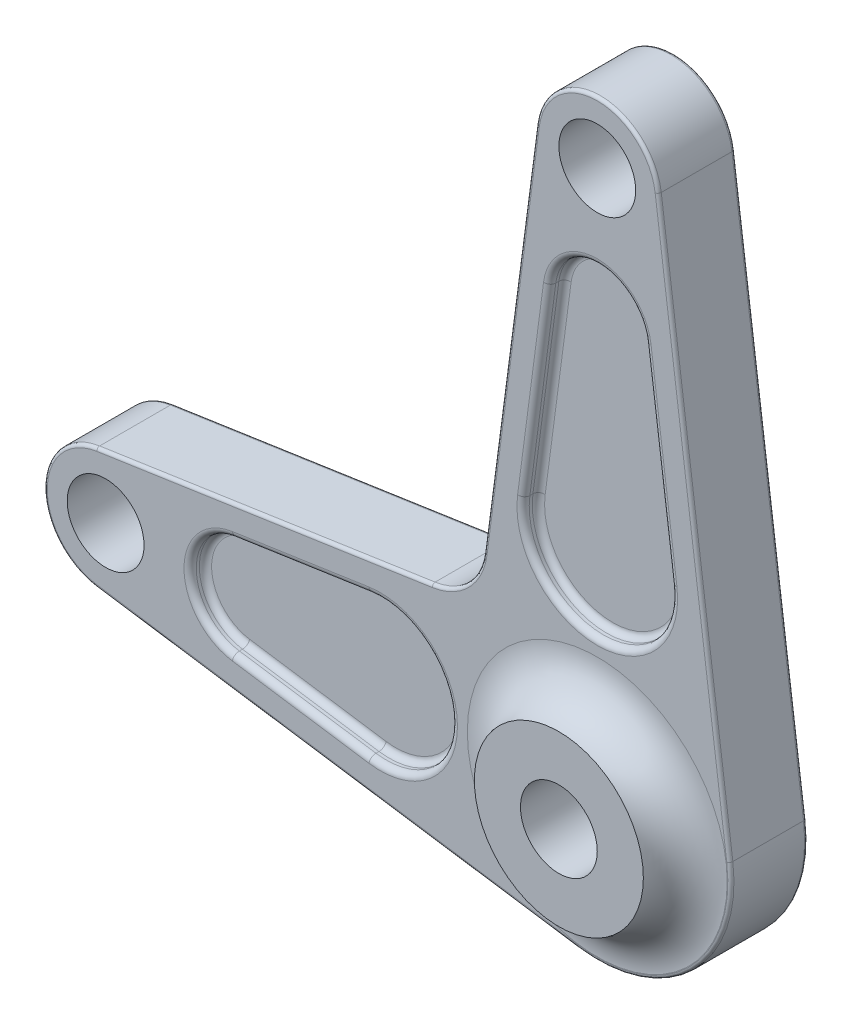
ISO-10303-21;
HEADER;
FILE_DESCRIPTION(('STEP AP214'),'2;1');
FILE_NAME('part.step','',(''),(''),'','','');
FILE_SCHEMA(('AUTOMOTIVE_DESIGN { 1 0 10303 214 1 1 1 1 }'));
ENDSEC;
DATA;
#1=APPLICATION_CONTEXT('core data for automotive mechanical design processes');
#2=APPLICATION_PROTOCOL_DEFINITION('international standard','automotive_design',2000,#1);
#3=PRODUCT_CONTEXT('',#1,'mechanical');
#4=PRODUCT('Part','Part','',(#3));
#5=PRODUCT_RELATED_PRODUCT_CATEGORY('part','',(#4));
#6=PRODUCT_DEFINITION_FORMATION('','',#4);
#7=PRODUCT_DEFINITION_CONTEXT('part definition',#1,'design');
#8=PRODUCT_DEFINITION('design','',#6,#7);
#9=PRODUCT_DEFINITION_SHAPE('','',#8);
#10=(LENGTH_UNIT() NAMED_UNIT(*) SI_UNIT(.MILLI.,.METRE.));
#11=(NAMED_UNIT(*) PLANE_ANGLE_UNIT() SI_UNIT($,.RADIAN.));
#12=(NAMED_UNIT(*) SI_UNIT($,.STERADIAN.) SOLID_ANGLE_UNIT());
#13=UNCERTAINTY_MEASURE_WITH_UNIT(LENGTH_MEASURE(1.E-05),#10,'distance_accuracy_value','');
#14=(GEOMETRIC_REPRESENTATION_CONTEXT(3) GLOBAL_UNCERTAINTY_ASSIGNED_CONTEXT((#13)) GLOBAL_UNIT_ASSIGNED_CONTEXT((#10,
#11,#12)) REPRESENTATION_CONTEXT('',''));
#15=CARTESIAN_POINT('',(0.,0.,0.));
#16=DIRECTION('',(0.,0.,1.));
#17=DIRECTION('',(1.,0.,0.));
#18=AXIS2_PLACEMENT_3D('',#15,#16,#17);
#19=CARTESIAN_POINT('',(-24.5492781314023,-235.273628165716,12.5));
#20=DIRECTION('',(0.,0.,1.));
#21=DIRECTION('',(1.,0.,0.));
#22=AXIS2_PLACEMENT_3D('',#19,#20,#21);
#23=PLANE('',#22);
#24=CARTESIAN_POINT('',(0.,0.,12.5));
#25=DIRECTION('',(0.,0.,1.));
#26=DIRECTION('',(1.,0.,0.));
#27=AXIS2_PLACEMENT_3D('',#24,#25,#26);
#28=CIRCLE('',#27,42.290199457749);
#29=CARTESIAN_POINT('',(42.290199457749,0.,12.5));
#30=VERTEX_POINT('',#29);
#31=EDGE_CURVE('E44',#30,#30,#28,.F.);
#32=ORIENTED_EDGE('',*,*,#31,.T.);
#33=EDGE_LOOP('',(#32));
#34=FACE_BOUND('',#33,.T.);
#35=CARTESIAN_POINT('',(0.,180.,12.5));
#36=DIRECTION('',(0.,0.,1.));
#37=DIRECTION('',(1.,0.,0.));
#38=AXIS2_PLACEMENT_3D('',#35,#36,#37);
#39=CIRCLE('',#38,19.);
#40=CARTESIAN_POINT('',(18.8374523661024,182.479997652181,12.5));
#41=VERTEX_POINT('',#40);
#42=CARTESIAN_POINT('',(-18.8374523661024,182.479997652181,12.5));
#43=VERTEX_POINT('',#42);
#44=EDGE_CURVE('E506',#41,#43,#39,.T.);
#45=ORIENTED_EDGE('',*,*,#44,.T.);
#46=DIRECTION('',(-0.130526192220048,-0.991444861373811,0.));
#47=VECTOR('',#46,1.);
#48=CARTESIAN_POINT('',(-35.8795618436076,53.0323244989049,12.5));
#49=LINE('',#48,#47);
#50=CARTESIAN_POINT('',(-35.8795618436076,53.0323244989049,12.5));
#51=VERTEX_POINT('',#50);
#52=EDGE_CURVE('E597',#43,#51,#49,.T.);
#53=ORIENTED_EDGE('',*,*,#52,.T.);
#54=CARTESIAN_POINT('',(-56.6999039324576,55.773374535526,12.5));
#55=DIRECTION('',(0.,0.,1.));
#56=DIRECTION('',(1.,0.,0.));
#57=AXIS2_PLACEMENT_3D('',#54,#55,#56);
#58=CIRCLE('',#57,21.);
#59=CARTESIAN_POINT('',(-53.616222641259,35.0010152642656,12.5));
#60=VERTEX_POINT('',#59);
#61=EDGE_CURVE('E595',#51,#60,#58,.F.);
#62=ORIENTED_EDGE('',*,*,#61,.T.);
#63=DIRECTION('',(-0.989159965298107,-0.146841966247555,0.));
#64=VECTOR('',#63,1.);
#65=CARTESIAN_POINT('',(-162.789997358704,18.7940393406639,12.5));
#66=LINE('',#65,#64);
#67=CARTESIAN_POINT('',(-162.789997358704,18.794039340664,12.5));
#68=VERTEX_POINT('',#67);
#69=EDGE_CURVE('E593',#60,#68,#66,.T.);
#70=ORIENTED_EDGE('',*,*,#69,.T.);
#71=CARTESIAN_POINT('',(-160.,0.,12.5));
#72=DIRECTION('',(0.,0.,1.));
#73=DIRECTION('',(1.,0.,0.));
#74=AXIS2_PLACEMENT_3D('',#71,#72,#73);
#75=CIRCLE('',#74,18.9999999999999);
#76=CARTESIAN_POINT('',(-162.789997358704,-18.7940393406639,12.5));
#77=VERTEX_POINT('',#76);
#78=EDGE_CURVE('E591',#68,#77,#75,.T.);
#79=ORIENTED_EDGE('',*,*,#78,.T.);
#80=DIRECTION('',(0.989159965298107,-0.146841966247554,0.));
#81=VECTOR('',#80,1.);
#82=CARTESIAN_POINT('',(-6.24000744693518,-42.0340704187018,12.5));
#83=LINE('',#82,#81);
#84=CARTESIAN_POINT('',(-6.24000744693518,-42.0340704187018,12.5));
#85=VERTEX_POINT('',#84);
#86=EDGE_CURVE('E589',#77,#85,#83,.T.);
#87=ORIENTED_EDGE('',*,*,#86,.T.);
#88=CARTESIAN_POINT('',(0.,0.,12.5));
#89=DIRECTION('',(0.,0.,1.));
#90=DIRECTION('',(1.,0.,0.));
#91=AXIS2_PLACEMENT_3D('',#88,#89,#90);
#92=CIRCLE('',#91,42.4947145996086);
#93=CARTESIAN_POINT('',(42.1311664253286,5.54667328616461,12.5));
#94=VERTEX_POINT('',#93);
#95=EDGE_CURVE('E587',#85,#94,#92,.T.);
#96=ORIENTED_EDGE('',*,*,#95,.T.);
#97=DIRECTION('',(-0.130526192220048,0.991444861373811,0.));
#98=VECTOR('',#97,1.);
#99=CARTESIAN_POINT('',(18.8374523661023,182.479997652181,12.5));
#100=LINE('',#99,#98);
#101=EDGE_CURVE('E585',#94,#41,#100,.T.);
#102=ORIENTED_EDGE('',*,*,#101,.T.);
#103=EDGE_LOOP('',(#45,#53,#62,#70,#79,#87,#96,#102));
#104=FACE_BOUND('',#103,.T.);
#105=CARTESIAN_POINT('',(0.,71.6433773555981,12.5));
#106=DIRECTION('',(0.,0.,1.));
#107=DIRECTION('',(1.,0.,0.));
#108=AXIS2_PLACEMENT_3D('',#105,#106,#107);
#109=CIRCLE('',#108,26.1433773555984);
#110=CARTESIAN_POINT('',(25.9197171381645,75.0557728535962,12.5));
#111=VERTEX_POINT('',#110);
#112=CARTESIAN_POINT('',(-25.9197171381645,75.0557728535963,12.5));
#113=VERTEX_POINT('',#112);
#114=EDGE_CURVE('E399',#111,#113,#109,.F.);
#115=ORIENTED_EDGE('',*,*,#114,.T.);
#116=DIRECTION('',(-0.130526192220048,-0.991444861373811,0.));
#117=VECTOR('',#116,1.);
#118=CARTESIAN_POINT('',(-66.055948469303,-229.809171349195,12.5));
#119=LINE('',#118,#117);
#120=CARTESIAN_POINT('',(-17.4787107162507,139.171582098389,12.5));
#121=VERTEX_POINT('',#120);
#122=EDGE_CURVE('E401',#113,#121,#119,.F.);
#123=ORIENTED_EDGE('',*,*,#122,.T.);
#124=CARTESIAN_POINT('',(0.,136.870466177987,12.5));
#125=DIRECTION('',(0.,0.,1.));
#126=DIRECTION('',(1.,0.,0.));
#127=AXIS2_PLACEMENT_3D('',#124,#125,#126);
#128=CIRCLE('',#127,17.6295338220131);
#129=CARTESIAN_POINT('',(17.4787107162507,139.171582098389,12.5));
#130=VERTEX_POINT('',#129);
#131=EDGE_CURVE('E395',#121,#130,#128,.F.);
#132=ORIENTED_EDGE('',*,*,#131,.T.);
#133=DIRECTION('',(0.130526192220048,-0.991444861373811,0.));
#134=VECTOR('',#133,1.);
#135=CARTESIAN_POINT('',(25.9197171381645,75.0557728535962,12.5));
#136=LINE('',#135,#134);
#137=EDGE_CURVE('E397',#130,#111,#136,.T.);
#138=ORIENTED_EDGE('',*,*,#137,.T.);
#139=EDGE_LOOP('',(#115,#123,#132,#138));
#140=FACE_BOUND('',#139,.T.);
#141=CARTESIAN_POINT('',(-70.6241286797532,0.,12.5));
#142=DIRECTION('',(0.,0.,1.));
#143=DIRECTION('',(1.,0.,0.));
#144=AXIS2_PLACEMENT_3D('',#141,#142,#143);
#145=CIRCLE('',#144,25.1241286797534);
#146=CARTESIAN_POINT('',(-74.3134051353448,24.8517822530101,12.5));
#147=VERTEX_POINT('',#146);
#148=CARTESIAN_POINT('',(-74.3134051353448,-24.85178225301,12.5));
#149=VERTEX_POINT('',#148);
#150=EDGE_CURVE('E390',#147,#149,#145,.F.);
#151=ORIENTED_EDGE('',*,*,#150,.T.);
#152=DIRECTION('',(0.989159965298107,-0.146841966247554,0.));
#153=VECTOR('',#152,1.);
#154=CARTESIAN_POINT('',(4.94149373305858,-36.6172656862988,12.5));
#155=LINE('',#154,#153);
#156=CARTESIAN_POINT('',(-118.755529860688,-18.2542962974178,12.5));
#157=VERTEX_POINT('',#156);
#158=EDGE_CURVE('E392',#149,#157,#155,.F.);
#159=ORIENTED_EDGE('',*,*,#158,.T.);
#160=CARTESIAN_POINT('',(-116.045657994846,0.,12.5));
#161=DIRECTION('',(0.,0.,1.));
#162=DIRECTION('',(1.,0.,0.));
#163=AXIS2_PLACEMENT_3D('',#160,#161,#162);
#164=CIRCLE('',#163,18.4543420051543);
#165=CARTESIAN_POINT('',(-118.755529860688,18.2542962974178,12.5));
#166=VERTEX_POINT('',#165);
#167=EDGE_CURVE('E386',#157,#166,#164,.F.);
#168=ORIENTED_EDGE('',*,*,#167,.T.);
#169=DIRECTION('',(0.989159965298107,0.146841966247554,0.));
#170=VECTOR('',#169,1.);
#171=CARTESIAN_POINT('',(-74.3134051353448,24.8517822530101,12.5));
#172=LINE('',#171,#170);
#173=EDGE_CURVE('E388',#166,#147,#172,.T.);
#174=ORIENTED_EDGE('',*,*,#173,.T.);
#175=EDGE_LOOP('',(#151,#159,#168,#174));
#176=FACE_BOUND('',#175,.T.);
#177=CARTESIAN_POINT('',(0.,180.,12.5));
#178=DIRECTION('',(0.,0.,1.));
#179=DIRECTION('',(1.,0.,0.));
#180=AXIS2_PLACEMENT_3D('',#177,#178,#179);
#181=CIRCLE('',#180,12.5);
#182=CARTESIAN_POINT('',(12.5,180.,12.5));
#183=VERTEX_POINT('',#182);
#184=EDGE_CURVE('E1010',#183,#183,#181,.T.);
#185=ORIENTED_EDGE('',*,*,#184,.F.);
#186=EDGE_LOOP('',(#185));
#187=FACE_BOUND('',#186,.T.);
#188=CARTESIAN_POINT('',(-160.,0.,12.5));
#189=DIRECTION('',(0.,0.,1.));
#190=DIRECTION('',(1.,0.,0.));
#191=AXIS2_PLACEMENT_3D('',#188,#189,#190);
#192=CIRCLE('',#191,12.5);
#193=CARTESIAN_POINT('',(-147.5,0.,12.5));
#194=VERTEX_POINT('',#193);
#195=EDGE_CURVE('E1016',#194,#194,#192,.T.);
#196=ORIENTED_EDGE('',*,*,#195,.F.);
#197=EDGE_LOOP('',(#196));
#198=FACE_BOUND('',#197,.T.);
#199=ADVANCED_FACE('F36',(#34,#104,#140,#176,#187,#198),#23,.T.);
#200=CARTESIAN_POINT('',(-24.5492781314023,-235.273628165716,-12.5));
#201=DIRECTION('',(0.,0.,1.));
#202=DIRECTION('',(1.,0.,0.));
#203=AXIS2_PLACEMENT_3D('',#200,#201,#202);
#204=PLANE('',#203);
#205=CARTESIAN_POINT('',(0.,0.,-12.5));
#206=DIRECTION('',(0.,0.,1.));
#207=DIRECTION('',(1.,0.,0.));
#208=AXIS2_PLACEMENT_3D('',#205,#206,#207);
#209=CIRCLE('',#208,42.290199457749);
#210=CARTESIAN_POINT('',(42.290199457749,0.,-12.5));
#211=VERTEX_POINT('',#210);
#212=EDGE_CURVE('E11',#211,#211,#209,.T.);
#213=ORIENTED_EDGE('',*,*,#212,.T.);
#214=EDGE_LOOP('',(#213));
#215=FACE_BOUND('',#214,.T.);
#216=CARTESIAN_POINT('',(0.,180.,-12.5));
#217=DIRECTION('',(0.,0.,1.));
#218=DIRECTION('',(1.,0.,0.));
#219=AXIS2_PLACEMENT_3D('',#216,#217,#218);
#220=CIRCLE('',#219,19.);
#221=CARTESIAN_POINT('',(-18.8374523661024,182.479997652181,-12.5));
#222=VERTEX_POINT('',#221);
#223=CARTESIAN_POINT('',(18.8374523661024,182.479997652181,-12.5));
#224=VERTEX_POINT('',#223);
#225=EDGE_CURVE('E634',#222,#224,#220,.F.);
#226=ORIENTED_EDGE('',*,*,#225,.T.);
#227=DIRECTION('',(-0.130526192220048,0.991444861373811,0.));
#228=VECTOR('',#227,1.);
#229=CARTESIAN_POINT('',(72.1595661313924,-222.541667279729,-12.5));
#230=LINE('',#229,#228);
#231=CARTESIAN_POINT('',(42.1311664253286,5.54667328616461,-12.5));
#232=VERTEX_POINT('',#231);
#233=EDGE_CURVE('E647',#224,#232,#230,.F.);
#234=ORIENTED_EDGE('',*,*,#233,.T.);
#235=CARTESIAN_POINT('',(0.,0.,-12.5));
#236=DIRECTION('',(0.,0.,1.));
#237=DIRECTION('',(1.,0.,0.));
#238=AXIS2_PLACEMENT_3D('',#235,#236,#237);
#239=CIRCLE('',#238,42.4947145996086);
#240=CARTESIAN_POINT('',(-6.24000744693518,-42.0340704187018,-12.5));
#241=VERTEX_POINT('',#240);
#242=EDGE_CURVE('E58',#232,#241,#239,.F.);
#243=ORIENTED_EDGE('',*,*,#242,.T.);
#244=DIRECTION('',(0.989159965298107,-0.146841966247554,0.));
#245=VECTOR('',#244,1.);
#246=CARTESIAN_POINT('',(3.91359996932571,-43.5413854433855,-12.5));
#247=LINE('',#246,#245);
#248=CARTESIAN_POINT('',(-162.789997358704,-18.794039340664,-12.5));
#249=VERTEX_POINT('',#248);
#250=EDGE_CURVE('E644',#241,#249,#247,.F.);
#251=ORIENTED_EDGE('',*,*,#250,.T.);
#252=CARTESIAN_POINT('',(-160.,0.,-12.5));
#253=DIRECTION('',(0.,0.,1.));
#254=DIRECTION('',(1.,0.,0.));
#255=AXIS2_PLACEMENT_3D('',#252,#253,#254);
#256=CIRCLE('',#255,18.9999999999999);
#257=CARTESIAN_POINT('',(-162.789997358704,18.7940393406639,-12.5));
#258=VERTEX_POINT('',#257);
#259=EDGE_CURVE('E642',#249,#258,#256,.F.);
#260=ORIENTED_EDGE('',*,*,#259,.T.);
#261=DIRECTION('',(-0.989159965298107,-0.146841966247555,0.));
#262=VECTOR('',#261,1.);
#263=CARTESIAN_POINT('',(-64.433480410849,33.3951805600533,-12.5));
#264=LINE('',#263,#262);
#265=CARTESIAN_POINT('',(-53.616222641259,35.0010152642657,-12.5));
#266=VERTEX_POINT('',#265);
#267=EDGE_CURVE('E640',#258,#266,#264,.F.);
#268=ORIENTED_EDGE('',*,*,#267,.T.);
#269=CARTESIAN_POINT('',(-56.6999039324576,55.773374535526,-12.5));
#270=DIRECTION('',(0.,0.,1.));
#271=DIRECTION('',(1.,0.,0.));
#272=AXIS2_PLACEMENT_3D('',#269,#270,#271);
#273=CIRCLE('',#272,21.);
#274=CARTESIAN_POINT('',(-35.8795618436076,53.0323244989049,-12.5));
#275=VERTEX_POINT('',#274);
#276=EDGE_CURVE('E638',#266,#275,#273,.T.);
#277=ORIENTED_EDGE('',*,*,#276,.T.);
#278=DIRECTION('',(-0.130526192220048,-0.991444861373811,0.));
#279=VECTOR('',#278,1.);
#280=CARTESIAN_POINT('',(-72.9960624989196,-228.895488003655,-12.5));
#281=LINE('',#280,#279);
#282=EDGE_CURVE('E636',#275,#222,#281,.F.);
#283=ORIENTED_EDGE('',*,*,#282,.T.);
#284=EDGE_LOOP('',(#226,#234,#243,#251,#260,#268,#277,#283));
#285=FACE_BOUND('',#284,.T.);
#286=DIRECTION('',(0.989159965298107,-0.146841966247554,0.));
#287=VECTOR('',#286,1.);
#288=CARTESIAN_POINT('',(4.94149373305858,-36.6172656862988,-12.5));
#289=LINE('',#288,#287);
#290=CARTESIAN_POINT('',(-118.755529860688,-18.2542962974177,-12.5));
#291=VERTEX_POINT('',#290);
#292=CARTESIAN_POINT('',(-74.3134051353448,-24.85178225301,-12.5));
#293=VERTEX_POINT('',#292);
#294=EDGE_CURVE('E494',#291,#293,#289,.T.);
#295=ORIENTED_EDGE('',*,*,#294,.T.);
#296=CARTESIAN_POINT('',(-70.6241286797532,0.,-12.5));
#297=DIRECTION('',(0.,0.,1.));
#298=DIRECTION('',(1.,0.,0.));
#299=AXIS2_PLACEMENT_3D('',#296,#297,#298);
#300=CIRCLE('',#299,25.1241286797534);
#301=CARTESIAN_POINT('',(-74.3134051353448,24.8517822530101,-12.5));
#302=VERTEX_POINT('',#301);
#303=EDGE_CURVE('E500',#293,#302,#300,.T.);
#304=ORIENTED_EDGE('',*,*,#303,.T.);
#305=DIRECTION('',(0.989159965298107,0.146841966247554,0.));
#306=VECTOR('',#305,1.);
#307=CARTESIAN_POINT('',(-118.755529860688,18.2542962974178,-12.5));
#308=LINE('',#307,#306);
#309=CARTESIAN_POINT('',(-118.755529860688,18.2542962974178,-12.5));
#310=VERTEX_POINT('',#309);
#311=EDGE_CURVE('E498',#302,#310,#308,.F.);
#312=ORIENTED_EDGE('',*,*,#311,.T.);
#313=CARTESIAN_POINT('',(-116.045657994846,0.,-12.5));
#314=DIRECTION('',(0.,0.,1.));
#315=DIRECTION('',(1.,0.,0.));
#316=AXIS2_PLACEMENT_3D('',#313,#314,#315);
#317=CIRCLE('',#316,18.4543420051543);
#318=EDGE_CURVE('E496',#310,#291,#317,.T.);
#319=ORIENTED_EDGE('',*,*,#318,.T.);
#320=EDGE_LOOP('',(#295,#304,#312,#319));
#321=FACE_BOUND('',#320,.T.);
#322=DIRECTION('',(-0.130526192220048,-0.991444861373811,0.));
#323=VECTOR('',#322,1.);
#324=CARTESIAN_POINT('',(-66.055948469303,-229.809171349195,-12.5));
#325=LINE('',#324,#323);
#326=CARTESIAN_POINT('',(-17.4787107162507,139.171582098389,-12.5));
#327=VERTEX_POINT('',#326);
#328=CARTESIAN_POINT('',(-25.9197171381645,75.0557728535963,-12.5));
#329=VERTEX_POINT('',#328);
#330=EDGE_CURVE('E485',#327,#329,#325,.T.);
#331=ORIENTED_EDGE('',*,*,#330,.T.);
#332=CARTESIAN_POINT('',(0.,71.6433773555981,-12.5));
#333=DIRECTION('',(0.,0.,1.));
#334=DIRECTION('',(1.,0.,0.));
#335=AXIS2_PLACEMENT_3D('',#332,#333,#334);
#336=CIRCLE('',#335,26.1433773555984);
#337=CARTESIAN_POINT('',(25.9197171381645,75.0557728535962,-12.5));
#338=VERTEX_POINT('',#337);
#339=EDGE_CURVE('E491',#329,#338,#336,.T.);
#340=ORIENTED_EDGE('',*,*,#339,.T.);
#341=DIRECTION('',(0.130526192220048,-0.991444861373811,0.));
#342=VECTOR('',#341,1.);
#343=CARTESIAN_POINT('',(17.4787107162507,139.171582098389,-12.5));
#344=LINE('',#343,#342);
#345=CARTESIAN_POINT('',(17.4787107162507,139.171582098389,-12.5));
#346=VERTEX_POINT('',#345);
#347=EDGE_CURVE('E489',#338,#346,#344,.F.);
#348=ORIENTED_EDGE('',*,*,#347,.T.);
#349=CARTESIAN_POINT('',(0.,136.870466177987,-12.5));
#350=DIRECTION('',(0.,0.,1.));
#351=DIRECTION('',(1.,0.,0.));
#352=AXIS2_PLACEMENT_3D('',#349,#350,#351);
#353=CIRCLE('',#352,17.6295338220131);
#354=EDGE_CURVE('E487',#346,#327,#353,.T.);
#355=ORIENTED_EDGE('',*,*,#354,.T.);
#356=EDGE_LOOP('',(#331,#340,#348,#355));
#357=FACE_BOUND('',#356,.T.);
#358=CARTESIAN_POINT('',(0.,180.,-12.5));
#359=DIRECTION('',(0.,0.,1.));
#360=DIRECTION('',(1.,0.,0.));
#361=AXIS2_PLACEMENT_3D('',#358,#359,#360);
#362=CIRCLE('',#361,12.5);
#363=CARTESIAN_POINT('',(12.5,180.,-12.5));
#364=VERTEX_POINT('',#363);
#365=EDGE_CURVE('E1013',#364,#364,#362,.T.);
#366=ORIENTED_EDGE('',*,*,#365,.T.);
#367=EDGE_LOOP('',(#366));
#368=FACE_BOUND('',#367,.T.);
#369=CARTESIAN_POINT('',(-160.,0.,-12.5));
#370=DIRECTION('',(0.,0.,1.));
#371=DIRECTION('',(1.,0.,0.));
#372=AXIS2_PLACEMENT_3D('',#369,#370,#371);
#373=CIRCLE('',#372,12.5);
#374=CARTESIAN_POINT('',(-147.5,0.,-12.5));
#375=VERTEX_POINT('',#374);
#376=EDGE_CURVE('E1017',#375,#375,#373,.T.);
#377=ORIENTED_EDGE('',*,*,#376,.T.);
#378=EDGE_LOOP('',(#377));
#379=FACE_BOUND('',#378,.T.);
#380=ADVANCED_FACE('F709',(#215,#285,#321,#357,#368,#379),#204,.F.);
#381=CARTESIAN_POINT('',(-56.6999039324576,55.773374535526,12.5));
#382=DIRECTION('',(0.,0.,-1.));
#383=DIRECTION('',(-1.,0.,0.));
#384=AXIS2_PLACEMENT_3D('',#381,#382,#383);
#385=CYLINDRICAL_SURFACE('',#384,20.);
#386=DIRECTION('',(0.,0.,-1.));
#387=VECTOR('',#386,1.);
#388=CARTESIAN_POINT('',(-53.7630646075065,35.9901752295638,12.5));
#389=LINE('',#388,#387);
#390=CARTESIAN_POINT('',(-53.7630646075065,35.9901752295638,11.5));
#391=VERTEX_POINT('',#390);
#392=CARTESIAN_POINT('',(-53.7630646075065,35.9901752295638,-11.5));
#393=VERTEX_POINT('',#392);
#394=EDGE_CURVE('E364',#391,#393,#389,.T.);
#395=ORIENTED_EDGE('',*,*,#394,.F.);
#396=CARTESIAN_POINT('',(-56.6999039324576,55.773374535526,11.5));
#397=DIRECTION('',(0.,0.,1.));
#398=DIRECTION('',(1.,0.,0.));
#399=AXIS2_PLACEMENT_3D('',#396,#397,#398);
#400=CIRCLE('',#399,20.);
#401=CARTESIAN_POINT('',(-36.8710067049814,53.1628506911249,11.5));
#402=VERTEX_POINT('',#401);
#403=EDGE_CURVE('E607',#391,#402,#400,.T.);
#404=ORIENTED_EDGE('',*,*,#403,.T.);
#405=DIRECTION('',(0.,0.,-1.));
#406=VECTOR('',#405,1.);
#407=CARTESIAN_POINT('',(-36.8710067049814,53.1628506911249,12.5));
#408=LINE('',#407,#406);
#409=CARTESIAN_POINT('',(-36.8710067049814,53.1628506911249,-11.5));
#410=VERTEX_POINT('',#409);
#411=EDGE_CURVE('E1005',#402,#410,#408,.T.);
#412=ORIENTED_EDGE('',*,*,#411,.T.);
#413=CARTESIAN_POINT('',(-56.6999039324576,55.773374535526,-11.5));
#414=DIRECTION('',(0.,0.,1.));
#415=DIRECTION('',(1.,0.,0.));
#416=AXIS2_PLACEMENT_3D('',#413,#414,#415);
#417=CIRCLE('',#416,20.);
#418=EDGE_CURVE('E605',#410,#393,#417,.F.);
#419=ORIENTED_EDGE('',*,*,#418,.T.);
#420=EDGE_LOOP('',(#395,#404,#412,#419));
#421=FACE_BOUND('',#420,.T.);
#422=ADVANCED_FACE('F714',(#421),#385,.F.);
#423=CARTESIAN_POINT('',(-64.5803223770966,34.3843405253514,12.5));
#424=DIRECTION('',(0.146841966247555,-0.989159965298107,0.));
#425=DIRECTION('',(0.989159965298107,0.146841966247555,0.));
#426=AXIS2_PLACEMENT_3D('',#423,#424,#425);
#427=PLANE('',#426);
#428=DIRECTION('',(0.,0.,-1.));
#429=VECTOR('',#428,1.);
#430=CARTESIAN_POINT('',(-162.936839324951,19.7831993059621,12.5));
#431=LINE('',#430,#429);
#432=CARTESIAN_POINT('',(-162.936839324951,19.7831993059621,11.5));
#433=VERTEX_POINT('',#432);
#434=CARTESIAN_POINT('',(-162.936839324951,19.7831993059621,-11.5));
#435=VERTEX_POINT('',#434);
#436=EDGE_CURVE('E978',#433,#435,#431,.T.);
#437=ORIENTED_EDGE('',*,*,#436,.F.);
#438=DIRECTION('',(-0.989159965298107,-0.146841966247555,0.));
#439=VECTOR('',#438,1.);
#440=CARTESIAN_POINT('',(-53.7630646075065,35.9901752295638,11.5));
#441=LINE('',#440,#439);
#442=EDGE_CURVE('E611',#433,#391,#441,.F.);
#443=ORIENTED_EDGE('',*,*,#442,.T.);
#444=ORIENTED_EDGE('',*,*,#394,.T.);
#445=DIRECTION('',(-0.989159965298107,-0.146841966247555,0.));
#446=VECTOR('',#445,1.);
#447=CARTESIAN_POINT('',(-64.5803223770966,34.3843405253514,-11.5));
#448=LINE('',#447,#446);
#449=EDGE_CURVE('E609',#393,#435,#448,.T.);
#450=ORIENTED_EDGE('',*,*,#449,.T.);
#451=EDGE_LOOP('',(#437,#443,#444,#450));
#452=FACE_BOUND('',#451,.T.);
#453=ADVANCED_FACE('F758',(#452),#427,.F.);
#454=CARTESIAN_POINT('',(-160.,0.,12.5));
#455=DIRECTION('',(0.,0.,-1.));
#456=DIRECTION('',(-1.,0.,0.));
#457=AXIS2_PLACEMENT_3D('',#454,#455,#456);
#458=CYLINDRICAL_SURFACE('',#457,19.9999999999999);
#459=DIRECTION('',(0.,0.,-1.));
#460=VECTOR('',#459,1.);
#461=CARTESIAN_POINT('',(-162.936839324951,-19.7831993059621,12.5));
#462=LINE('',#461,#460);
#463=CARTESIAN_POINT('',(-162.936839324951,-19.7831993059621,11.5));
#464=VERTEX_POINT('',#463);
#465=CARTESIAN_POINT('',(-162.936839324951,-19.7831993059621,-11.5));
#466=VERTEX_POINT('',#465);
#467=EDGE_CURVE('E972',#464,#466,#462,.T.);
#468=ORIENTED_EDGE('',*,*,#467,.F.);
#469=CARTESIAN_POINT('',(-160.,0.,11.5));
#470=DIRECTION('',(0.,0.,1.));
#471=DIRECTION('',(1.,0.,0.));
#472=AXIS2_PLACEMENT_3D('',#469,#470,#471);
#473=CIRCLE('',#472,19.9999999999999);
#474=EDGE_CURVE('E615',#464,#433,#473,.F.);
#475=ORIENTED_EDGE('',*,*,#474,.T.);
#476=ORIENTED_EDGE('',*,*,#436,.T.);
#477=CARTESIAN_POINT('',(-160.,0.,-11.5));
#478=DIRECTION('',(0.,0.,1.));
#479=DIRECTION('',(1.,0.,0.));
#480=AXIS2_PLACEMENT_3D('',#477,#478,#479);
#481=CIRCLE('',#480,19.9999999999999);
#482=EDGE_CURVE('E613',#435,#466,#481,.T.);
#483=ORIENTED_EDGE('',*,*,#482,.T.);
#484=EDGE_LOOP('',(#468,#475,#476,#483));
#485=FACE_BOUND('',#484,.T.);
#486=ADVANCED_FACE('F754',(#485),#458,.T.);
#487=CARTESIAN_POINT('',(3.76675800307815,-44.5305454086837,12.5));
#488=DIRECTION('',(0.146841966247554,0.989159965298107,0.));
#489=DIRECTION('',(-0.989159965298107,0.146841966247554,0.));
#490=AXIS2_PLACEMENT_3D('',#487,#488,#489);
#491=PLANE('',#490);
#492=DIRECTION('',(0.,0.,-1.));
#493=VECTOR('',#492,1.);
#494=CARTESIAN_POINT('',(-6.38684941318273,-43.0232303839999,12.5));
#495=LINE('',#494,#493);
#496=CARTESIAN_POINT('',(-6.38684941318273,-43.0232303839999,11.5));
#497=VERTEX_POINT('',#496);
#498=CARTESIAN_POINT('',(-6.38684941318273,-43.0232303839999,-11.5));
#499=VERTEX_POINT('',#498);
#500=EDGE_CURVE('E969',#497,#499,#495,.T.);
#501=ORIENTED_EDGE('',*,*,#500,.F.);
#502=DIRECTION('',(0.989159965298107,-0.146841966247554,0.));
#503=VECTOR('',#502,1.);
#504=CARTESIAN_POINT('',(-162.936839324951,-19.7831993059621,11.5));
#505=LINE('',#504,#503);
#506=EDGE_CURVE('E619',#497,#464,#505,.F.);
#507=ORIENTED_EDGE('',*,*,#506,.T.);
#508=ORIENTED_EDGE('',*,*,#467,.T.);
#509=DIRECTION('',(0.989159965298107,-0.146841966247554,0.));
#510=VECTOR('',#509,1.);
#511=CARTESIAN_POINT('',(3.76675800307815,-44.5305454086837,-11.5));
#512=LINE('',#511,#510);
#513=EDGE_CURVE('E617',#466,#499,#512,.T.);
#514=ORIENTED_EDGE('',*,*,#513,.T.);
#515=EDGE_LOOP('',(#501,#507,#508,#514));
#516=FACE_BOUND('',#515,.T.);
#517=ADVANCED_FACE('F750',(#516),#491,.F.);
#518=CARTESIAN_POINT('',(0.,0.,12.5));
#519=DIRECTION('',(0.,0.,-1.));
#520=DIRECTION('',(-1.,0.,0.));
#521=AXIS2_PLACEMENT_3D('',#518,#519,#520);
#522=CYLINDRICAL_SURFACE('',#521,43.4947145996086);
#523=DIRECTION('',(0.,0.,-1.));
#524=VECTOR('',#523,1.);
#525=CARTESIAN_POINT('',(43.1226112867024,5.67719947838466,12.5));
#526=LINE('',#525,#524);
#527=CARTESIAN_POINT('',(43.1226112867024,5.67719947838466,11.5));
#528=VERTEX_POINT('',#527);
#529=CARTESIAN_POINT('',(43.1226112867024,5.67719947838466,-11.5));
#530=VERTEX_POINT('',#529);
#531=EDGE_CURVE('E976',#528,#530,#526,.T.);
#532=ORIENTED_EDGE('',*,*,#531,.F.);
#533=CARTESIAN_POINT('',(0.,0.,11.5));
#534=DIRECTION('',(0.,0.,1.));
#535=DIRECTION('',(1.,0.,0.));
#536=AXIS2_PLACEMENT_3D('',#533,#534,#535);
#537=CIRCLE('',#536,43.4947145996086);
#538=EDGE_CURVE('E623',#528,#497,#537,.F.);
#539=ORIENTED_EDGE('',*,*,#538,.T.);
#540=ORIENTED_EDGE('',*,*,#500,.T.);
#541=CARTESIAN_POINT('',(0.,0.,-11.5));
#542=DIRECTION('',(0.,0.,1.));
#543=DIRECTION('',(1.,0.,0.));
#544=AXIS2_PLACEMENT_3D('',#541,#542,#543);
#545=CIRCLE('',#544,43.4947145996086);
#546=EDGE_CURVE('E621',#499,#530,#545,.T.);
#547=ORIENTED_EDGE('',*,*,#546,.T.);
#548=EDGE_LOOP('',(#532,#539,#540,#547));
#549=FACE_BOUND('',#548,.T.);
#550=ADVANCED_FACE('F746',(#549),#522,.T.);
#551=CARTESIAN_POINT('',(73.1510109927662,-222.411141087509,12.5));
#552=DIRECTION('',(-0.991444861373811,-0.130526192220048,0.));
#553=DIRECTION('',(0.130526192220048,-0.991444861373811,0.));
#554=AXIS2_PLACEMENT_3D('',#551,#552,#553);
#555=PLANE('',#554);
#556=DIRECTION('',(0.,0.,-1.));
#557=VECTOR('',#556,1.);
#558=CARTESIAN_POINT('',(19.8288972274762,182.610523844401,12.5));
#559=LINE('',#558,#557);
#560=CARTESIAN_POINT('',(19.8288972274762,182.610523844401,11.5));
#561=VERTEX_POINT('',#560);
#562=CARTESIAN_POINT('',(19.8288972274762,182.610523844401,-11.5));
#563=VERTEX_POINT('',#562);
#564=EDGE_CURVE('E980',#561,#563,#559,.T.);
#565=ORIENTED_EDGE('',*,*,#564,.F.);
#566=DIRECTION('',(-0.130526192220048,0.991444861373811,0.));
#567=VECTOR('',#566,1.);
#568=CARTESIAN_POINT('',(43.1226112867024,5.6771994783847,11.5));
#569=LINE('',#568,#567);
#570=EDGE_CURVE('E628',#561,#528,#569,.F.);
#571=ORIENTED_EDGE('',*,*,#570,.T.);
#572=ORIENTED_EDGE('',*,*,#531,.T.);
#573=DIRECTION('',(-0.130526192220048,0.991444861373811,0.));
#574=VECTOR('',#573,1.);
#575=CARTESIAN_POINT('',(73.1510109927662,-222.411141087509,-11.5));
#576=LINE('',#575,#574);
#577=EDGE_CURVE('E625',#530,#563,#576,.T.);
#578=ORIENTED_EDGE('',*,*,#577,.T.);
#579=EDGE_LOOP('',(#565,#571,#572,#578));
#580=FACE_BOUND('',#579,.T.);
#581=ADVANCED_FACE('F742',(#580),#555,.F.);
#582=CARTESIAN_POINT('',(0.,180.,12.5));
#583=DIRECTION('',(0.,0.,-1.));
#584=DIRECTION('',(-1.,0.,0.));
#585=AXIS2_PLACEMENT_3D('',#582,#583,#584);
#586=CYLINDRICAL_SURFACE('',#585,20.);
#587=DIRECTION('',(0.,0.,-1.));
#588=VECTOR('',#587,1.);
#589=CARTESIAN_POINT('',(-19.8288972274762,182.610523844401,12.5));
#590=LINE('',#589,#588);
#591=CARTESIAN_POINT('',(-19.8288972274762,182.610523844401,11.5));
#592=VERTEX_POINT('',#591);
#593=CARTESIAN_POINT('',(-19.8288972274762,182.610523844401,-11.5));
#594=VERTEX_POINT('',#593);
#595=EDGE_CURVE('E1003',#592,#594,#590,.T.);
#596=ORIENTED_EDGE('',*,*,#595,.F.);
#597=CARTESIAN_POINT('',(0.,180.,11.5));
#598=DIRECTION('',(0.,0.,1.));
#599=DIRECTION('',(1.,0.,0.));
#600=AXIS2_PLACEMENT_3D('',#597,#598,#599);
#601=CIRCLE('',#600,20.);
#602=EDGE_CURVE('E632',#592,#561,#601,.F.);
#603=ORIENTED_EDGE('',*,*,#602,.T.);
#604=ORIENTED_EDGE('',*,*,#564,.T.);
#605=CARTESIAN_POINT('',(0.,180.,-11.5));
#606=DIRECTION('',(0.,0.,1.));
#607=DIRECTION('',(1.,0.,0.));
#608=AXIS2_PLACEMENT_3D('',#605,#606,#607);
#609=CIRCLE('',#608,20.);
#610=EDGE_CURVE('E630',#563,#594,#609,.T.);
#611=ORIENTED_EDGE('',*,*,#610,.T.);
#612=EDGE_LOOP('',(#596,#603,#604,#611));
#613=FACE_BOUND('',#612,.T.);
#614=ADVANCED_FACE('F731',(#613),#586,.T.);
#615=CARTESIAN_POINT('',(0.,180.,12.5));
#616=DIRECTION('',(0.,0.,-1.));
#617=DIRECTION('',(-1.,0.,0.));
#618=AXIS2_PLACEMENT_3D('',#615,#616,#617);
#619=CYLINDRICAL_SURFACE('',#618,12.5);
#620=ORIENTED_EDGE('',*,*,#184,.T.);
#621=EDGE_LOOP('',(#620));
#622=FACE_BOUND('',#621,.T.);
#623=ORIENTED_EDGE('',*,*,#365,.F.);
#624=EDGE_LOOP('',(#623));
#625=FACE_BOUND('',#624,.T.);
#626=ADVANCED_FACE('F727',(#622,#625),#619,.F.);
#627=CARTESIAN_POINT('',(-160.,0.,12.5));
#628=DIRECTION('',(0.,0.,-1.));
#629=DIRECTION('',(-1.,0.,0.));
#630=AXIS2_PLACEMENT_3D('',#627,#628,#629);
#631=CYLINDRICAL_SURFACE('',#630,12.5);
#632=ORIENTED_EDGE('',*,*,#195,.T.);
#633=EDGE_LOOP('',(#632));
#634=FACE_BOUND('',#633,.T.);
#635=ORIENTED_EDGE('',*,*,#376,.F.);
#636=EDGE_LOOP('',(#635));
#637=FACE_BOUND('',#636,.T.);
#638=ADVANCED_FACE('F730',(#634,#637),#631,.F.);
#639=CARTESIAN_POINT('',(-73.9875073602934,-228.764961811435,12.5));
#640=DIRECTION('',(0.991444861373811,-0.130526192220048,0.));
#641=DIRECTION('',(0.130526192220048,0.991444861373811,0.));
#642=AXIS2_PLACEMENT_3D('',#639,#640,#641);
#643=PLANE('',#642);
#644=ORIENTED_EDGE('',*,*,#411,.F.);
#645=DIRECTION('',(-0.130526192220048,-0.991444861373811,0.));
#646=VECTOR('',#645,1.);
#647=CARTESIAN_POINT('',(-19.8288972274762,182.610523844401,11.5));
#648=LINE('',#647,#646);
#649=EDGE_CURVE('E602',#402,#592,#648,.F.);
#650=ORIENTED_EDGE('',*,*,#649,.T.);
#651=ORIENTED_EDGE('',*,*,#595,.T.);
#652=DIRECTION('',(-0.130526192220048,-0.991444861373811,0.));
#653=VECTOR('',#652,1.);
#654=CARTESIAN_POINT('',(-73.9875073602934,-228.764961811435,-11.5));
#655=LINE('',#654,#653);
#656=EDGE_CURVE('E600',#594,#410,#655,.T.);
#657=ORIENTED_EDGE('',*,*,#656,.T.);
#658=EDGE_LOOP('',(#644,#650,#651,#657));
#659=FACE_BOUND('',#658,.T.);
#660=ADVANCED_FACE('F735',(#659),#643,.F.);
#661=CARTESIAN_POINT('',(5.23517766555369,-34.6389457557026,12.5));
#662=DIRECTION('',(0.146841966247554,0.989159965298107,0.));
#663=DIRECTION('',(-0.989159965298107,0.146841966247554,0.));
#664=AXIS2_PLACEMENT_3D('',#661,#662,#663);
#665=PLANE('',#664);
#666=DIRECTION('',(0.,0.,-1.));
#667=VECTOR('',#666,1.);
#668=CARTESIAN_POINT('',(-74.0197212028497,-22.8734623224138,12.5));
#669=LINE('',#668,#667);
#670=CARTESIAN_POINT('',(-74.0197212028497,-22.8734623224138,10.5));
#671=VERTEX_POINT('',#670);
#672=CARTESIAN_POINT('',(-74.0197212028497,-22.8734623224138,9.5));
#673=VERTEX_POINT('',#672);
#674=EDGE_CURVE('E1020',#671,#673,#669,.T.);
#675=ORIENTED_EDGE('',*,*,#674,.T.);
#676=DIRECTION('',(0.989159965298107,-0.146841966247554,0.));
#677=VECTOR('',#676,1.);
#678=CARTESIAN_POINT('',(-118.461845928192,-16.2759763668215,9.5));
#679=LINE('',#678,#677);
#680=CARTESIAN_POINT('',(-118.461845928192,-16.2759763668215,9.5));
#681=VERTEX_POINT('',#680);
#682=EDGE_CURVE('E420',#673,#681,#679,.F.);
#683=ORIENTED_EDGE('',*,*,#682,.T.);
#684=DIRECTION('',(0.,0.,-1.));
#685=VECTOR('',#684,1.);
#686=CARTESIAN_POINT('',(-118.461845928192,-16.2759763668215,12.5));
#687=LINE('',#686,#685);
#688=CARTESIAN_POINT('',(-118.461845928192,-16.2759763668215,10.5));
#689=VERTEX_POINT('',#688);
#690=EDGE_CURVE('E1033',#689,#681,#687,.T.);
#691=ORIENTED_EDGE('',*,*,#690,.F.);
#692=DIRECTION('',(0.989159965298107,-0.146841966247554,0.));
#693=VECTOR('',#692,1.);
#694=CARTESIAN_POINT('',(5.23517766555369,-34.6389457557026,10.5));
#695=LINE('',#694,#693);
#696=EDGE_CURVE('E417',#689,#671,#695,.T.);
#697=ORIENTED_EDGE('',*,*,#696,.T.);
#698=EDGE_LOOP('',(#675,#683,#691,#697));
#699=FACE_BOUND('',#698,.T.);
#700=ADVANCED_FACE('F718',(#699),#665,.T.);
#701=CARTESIAN_POINT('',(-70.6241286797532,0.,12.5));
#702=DIRECTION('',(0.,0.,-1.));
#703=DIRECTION('',(-1.,0.,0.));
#704=AXIS2_PLACEMENT_3D('',#701,#702,#703);
#705=CYLINDRICAL_SURFACE('',#704,23.1241286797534);
#706=DIRECTION('',(0.,0.,-1.));
#707=VECTOR('',#706,1.);
#708=CARTESIAN_POINT('',(-74.0197212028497,22.8734623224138,12.5));
#709=LINE('',#708,#707);
#710=CARTESIAN_POINT('',(-74.0197212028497,22.8734623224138,10.5));
#711=VERTEX_POINT('',#710);
#712=CARTESIAN_POINT('',(-74.0197212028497,22.8734623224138,9.5));
#713=VERTEX_POINT('',#712);
#714=EDGE_CURVE('E1027',#711,#713,#709,.T.);
#715=ORIENTED_EDGE('',*,*,#714,.T.);
#716=CARTESIAN_POINT('',(-70.6241286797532,0.,9.5));
#717=DIRECTION('',(0.,0.,1.));
#718=DIRECTION('',(1.,0.,0.));
#719=AXIS2_PLACEMENT_3D('',#716,#717,#718);
#720=CIRCLE('',#719,23.1241286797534);
#721=EDGE_CURVE('E425',#713,#673,#720,.F.);
#722=ORIENTED_EDGE('',*,*,#721,.T.);
#723=ORIENTED_EDGE('',*,*,#674,.F.);
#724=CARTESIAN_POINT('',(-70.6241286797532,0.,10.5));
#725=DIRECTION('',(0.,0.,1.));
#726=DIRECTION('',(1.,0.,0.));
#727=AXIS2_PLACEMENT_3D('',#724,#725,#726);
#728=CIRCLE('',#727,23.1241286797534);
#729=EDGE_CURVE('E423',#671,#711,#728,.T.);
#730=ORIENTED_EDGE('',*,*,#729,.T.);
#731=EDGE_LOOP('',(#715,#722,#723,#730));
#732=FACE_BOUND('',#731,.T.);
#733=ADVANCED_FACE('F1193',(#732),#705,.F.);
#734=CARTESIAN_POINT('',(-63.1119027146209,24.4927408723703,12.5));
#735=DIRECTION('',(-0.146841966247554,0.989159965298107,0.));
#736=DIRECTION('',(-0.989159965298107,-0.146841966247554,0.));
#737=AXIS2_PLACEMENT_3D('',#734,#735,#736);
#738=PLANE('',#737);
#739=DIRECTION('',(0.,0.,-1.));
#740=VECTOR('',#739,1.);
#741=CARTESIAN_POINT('',(-118.461845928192,16.2759763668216,12.5));
#742=LINE('',#741,#740);
#743=CARTESIAN_POINT('',(-118.461845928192,16.2759763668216,10.5));
#744=VERTEX_POINT('',#743);
#745=CARTESIAN_POINT('',(-118.461845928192,16.2759763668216,9.5));
#746=VERTEX_POINT('',#745);
#747=EDGE_CURVE('E1030',#744,#746,#742,.T.);
#748=ORIENTED_EDGE('',*,*,#747,.T.);
#749=DIRECTION('',(0.989159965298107,0.146841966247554,0.));
#750=VECTOR('',#749,1.);
#751=CARTESIAN_POINT('',(-63.1119027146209,24.4927408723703,9.5));
#752=LINE('',#751,#750);
#753=EDGE_CURVE('E429',#746,#713,#752,.T.);
#754=ORIENTED_EDGE('',*,*,#753,.T.);
#755=ORIENTED_EDGE('',*,*,#714,.F.);
#756=DIRECTION('',(0.989159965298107,0.146841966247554,0.));
#757=VECTOR('',#756,1.);
#758=CARTESIAN_POINT('',(-118.461845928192,16.2759763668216,10.5));
#759=LINE('',#758,#757);
#760=EDGE_CURVE('E427',#711,#744,#759,.F.);
#761=ORIENTED_EDGE('',*,*,#760,.T.);
#762=EDGE_LOOP('',(#748,#754,#755,#761));
#763=FACE_BOUND('',#762,.T.);
#764=ADVANCED_FACE('F1190',(#763),#738,.F.);
#765=CARTESIAN_POINT('',(-116.045657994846,0.,12.5));
#766=DIRECTION('',(0.,0.,-1.));
#767=DIRECTION('',(-1.,0.,0.));
#768=AXIS2_PLACEMENT_3D('',#765,#766,#767);
#769=CYLINDRICAL_SURFACE('',#768,16.4543420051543);
#770=ORIENTED_EDGE('',*,*,#690,.T.);
#771=CARTESIAN_POINT('',(-116.045657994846,0.,9.5));
#772=DIRECTION('',(0.,0.,1.));
#773=DIRECTION('',(1.,0.,0.));
#774=AXIS2_PLACEMENT_3D('',#771,#772,#773);
#775=CIRCLE('',#774,16.4543420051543);
#776=EDGE_CURVE('E433',#681,#746,#775,.F.);
#777=ORIENTED_EDGE('',*,*,#776,.T.);
#778=ORIENTED_EDGE('',*,*,#747,.F.);
#779=CARTESIAN_POINT('',(-116.045657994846,0.,10.5));
#780=DIRECTION('',(0.,0.,1.));
#781=DIRECTION('',(1.,0.,0.));
#782=AXIS2_PLACEMENT_3D('',#779,#780,#781);
#783=CIRCLE('',#782,16.4543420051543);
#784=EDGE_CURVE('E431',#744,#689,#783,.T.);
#785=ORIENTED_EDGE('',*,*,#784,.T.);
#786=EDGE_LOOP('',(#770,#777,#778,#785));
#787=FACE_BOUND('',#786,.T.);
#788=ADVANCED_FACE('F1186',(#787),#769,.F.);
#789=CARTESIAN_POINT('',(-24.5492781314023,-235.273628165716,7.5));
#790=DIRECTION('',(0.,0.,1.));
#791=DIRECTION('',(1.,0.,0.));
#792=AXIS2_PLACEMENT_3D('',#789,#790,#791);
#793=PLANE('',#792);
#794=CARTESIAN_POINT('',(-116.045657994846,0.,7.5));
#795=DIRECTION('',(0.,0.,1.));
#796=DIRECTION('',(1.,0.,0.));
#797=AXIS2_PLACEMENT_3D('',#794,#795,#796);
#798=CIRCLE('',#797,14.4543420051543);
#799=CARTESIAN_POINT('',(-118.168161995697,14.2976564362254,7.5));
#800=VERTEX_POINT('',#799);
#801=CARTESIAN_POINT('',(-118.168161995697,-14.2976564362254,7.5));
#802=VERTEX_POINT('',#801);
#803=EDGE_CURVE('E408',#800,#802,#798,.T.);
#804=ORIENTED_EDGE('',*,*,#803,.T.);
#805=DIRECTION('',(0.989159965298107,-0.146841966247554,0.));
#806=VECTOR('',#805,1.);
#807=CARTESIAN_POINT('',(-73.7260372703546,-20.8951423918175,7.5));
#808=LINE('',#807,#806);
#809=CARTESIAN_POINT('',(-73.7260372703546,-20.8951423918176,7.5));
#810=VERTEX_POINT('',#809);
#811=EDGE_CURVE('E414',#802,#810,#808,.T.);
#812=ORIENTED_EDGE('',*,*,#811,.T.);
#813=CARTESIAN_POINT('',(-70.6241286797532,0.,7.5));
#814=DIRECTION('',(0.,0.,1.));
#815=DIRECTION('',(1.,0.,0.));
#816=AXIS2_PLACEMENT_3D('',#813,#814,#815);
#817=CIRCLE('',#816,21.1241286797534);
#818=CARTESIAN_POINT('',(-73.7260372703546,20.8951423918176,7.5));
#819=VERTEX_POINT('',#818);
#820=EDGE_CURVE('E412',#810,#819,#817,.T.);
#821=ORIENTED_EDGE('',*,*,#820,.T.);
#822=DIRECTION('',(0.989159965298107,0.146841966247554,0.));
#823=VECTOR('',#822,1.);
#824=CARTESIAN_POINT('',(-62.8182187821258,22.5144209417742,7.5));
#825=LINE('',#824,#823);
#826=EDGE_CURVE('E410',#819,#800,#825,.F.);
#827=ORIENTED_EDGE('',*,*,#826,.T.);
#828=EDGE_LOOP('',(#804,#812,#821,#827));
#829=FACE_BOUND('',#828,.T.);
#830=ADVANCED_FACE('F1182',(#829),#793,.T.);
#831=CARTESIAN_POINT('',(-64.0730587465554,-230.070223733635,12.5));
#832=DIRECTION('',(0.991444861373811,-0.130526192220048,0.));
#833=DIRECTION('',(0.130526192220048,0.991444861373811,0.));
#834=AXIS2_PLACEMENT_3D('',#831,#832,#833);
#835=PLANE('',#834);
#836=DIRECTION('',(0.,0.,-1.));
#837=VECTOR('',#836,1.);
#838=CARTESIAN_POINT('',(-23.9368274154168,74.7947204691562,12.5));
#839=LINE('',#838,#837);
#840=CARTESIAN_POINT('',(-23.9368274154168,74.7947204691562,10.5));
#841=VERTEX_POINT('',#840);
#842=CARTESIAN_POINT('',(-23.9368274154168,74.7947204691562,9.5));
#843=VERTEX_POINT('',#842);
#844=EDGE_CURVE('E1036',#841,#843,#839,.T.);
#845=ORIENTED_EDGE('',*,*,#844,.T.);
#846=DIRECTION('',(-0.130526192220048,-0.991444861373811,0.));
#847=VECTOR('',#846,1.);
#848=CARTESIAN_POINT('',(-15.4958209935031,138.910529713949,9.5));
#849=LINE('',#848,#847);
#850=CARTESIAN_POINT('',(-15.4958209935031,138.910529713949,9.5));
#851=VERTEX_POINT('',#850);
#852=EDGE_CURVE('E350',#843,#851,#849,.F.);
#853=ORIENTED_EDGE('',*,*,#852,.T.);
#854=DIRECTION('',(0.,0.,-1.));
#855=VECTOR('',#854,1.);
#856=CARTESIAN_POINT('',(-15.4958209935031,138.910529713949,12.5));
#857=LINE('',#856,#855);
#858=CARTESIAN_POINT('',(-15.4958209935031,138.910529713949,10.5));
#859=VERTEX_POINT('',#858);
#860=EDGE_CURVE('E1045',#859,#851,#857,.T.);
#861=ORIENTED_EDGE('',*,*,#860,.F.);
#862=DIRECTION('',(-0.130526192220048,-0.991444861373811,0.));
#863=VECTOR('',#862,1.);
#864=CARTESIAN_POINT('',(-64.0730587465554,-230.070223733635,10.5));
#865=LINE('',#864,#863);
#866=EDGE_CURVE('E371',#859,#841,#865,.T.);
#867=ORIENTED_EDGE('',*,*,#866,.T.);
#868=EDGE_LOOP('',(#845,#853,#861,#867));
#869=FACE_BOUND('',#868,.T.);
#870=ADVANCED_FACE('F1178',(#869),#835,.T.);
#871=CARTESIAN_POINT('',(0.,71.6433773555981,12.5));
#872=DIRECTION('',(0.,0.,-1.));
#873=DIRECTION('',(-1.,0.,0.));
#874=AXIS2_PLACEMENT_3D('',#871,#872,#873);
#875=CYLINDRICAL_SURFACE('',#874,24.1433773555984);
#876=ORIENTED_EDGE('',*,*,#844,.F.);
#877=CARTESIAN_POINT('',(0.,71.6433773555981,10.5));
#878=DIRECTION('',(0.,0.,1.));
#879=DIRECTION('',(1.,0.,0.));
#880=AXIS2_PLACEMENT_3D('',#877,#878,#879);
#881=CIRCLE('',#880,24.1433773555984);
#882=CARTESIAN_POINT('',(23.9368274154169,74.7947204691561,10.5));
#883=VERTEX_POINT('',#882);
#884=EDGE_CURVE('E406',#841,#883,#881,.T.);
#885=ORIENTED_EDGE('',*,*,#884,.T.);
#886=DIRECTION('',(0.,0.,-1.));
#887=VECTOR('',#886,1.);
#888=CARTESIAN_POINT('',(23.9368274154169,74.7947204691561,12.5));
#889=LINE('',#888,#887);
#890=CARTESIAN_POINT('',(23.9368274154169,74.7947204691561,9.5));
#891=VERTEX_POINT('',#890);
#892=EDGE_CURVE('E1039',#883,#891,#889,.T.);
#893=ORIENTED_EDGE('',*,*,#892,.T.);
#894=CARTESIAN_POINT('',(0.,71.6433773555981,9.5));
#895=DIRECTION('',(0.,0.,1.));
#896=DIRECTION('',(1.,0.,0.));
#897=AXIS2_PLACEMENT_3D('',#894,#895,#896);
#898=CIRCLE('',#897,24.1433773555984);
#899=EDGE_CURVE('E404',#891,#843,#898,.F.);
#900=ORIENTED_EDGE('',*,*,#899,.T.);
#901=EDGE_LOOP('',(#876,#885,#893,#900));
#902=FACE_BOUND('',#901,.T.);
#903=ADVANCED_FACE('F1174',(#902),#875,.F.);
#904=CARTESIAN_POINT('',(63.2365623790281,-223.71640300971,12.5));
#905=DIRECTION('',(0.991444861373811,0.130526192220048,0.));
#906=DIRECTION('',(-0.130526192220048,0.991444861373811,0.));
#907=AXIS2_PLACEMENT_3D('',#904,#905,#906);
#908=PLANE('',#907);
#909=DIRECTION('',(0.,0.,-1.));
#910=VECTOR('',#909,1.);
#911=CARTESIAN_POINT('',(15.4958209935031,138.910529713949,12.5));
#912=LINE('',#911,#910);
#913=CARTESIAN_POINT('',(15.4958209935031,138.910529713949,10.5));
#914=VERTEX_POINT('',#913);
#915=CARTESIAN_POINT('',(15.4958209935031,138.910529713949,9.5));
#916=VERTEX_POINT('',#915);
#917=EDGE_CURVE('E1042',#914,#916,#912,.T.);
#918=ORIENTED_EDGE('',*,*,#917,.T.);
#919=DIRECTION('',(0.130526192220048,-0.991444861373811,0.));
#920=VECTOR('',#919,1.);
#921=CARTESIAN_POINT('',(63.2365623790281,-223.71640300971,9.5));
#922=LINE('',#921,#920);
#923=EDGE_CURVE('E380',#916,#891,#922,.T.);
#924=ORIENTED_EDGE('',*,*,#923,.T.);
#925=ORIENTED_EDGE('',*,*,#892,.F.);
#926=DIRECTION('',(0.130526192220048,-0.991444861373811,0.));
#927=VECTOR('',#926,1.);
#928=CARTESIAN_POINT('',(15.4958209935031,138.910529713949,10.5));
#929=LINE('',#928,#927);
#930=EDGE_CURVE('E378',#883,#914,#929,.F.);
#931=ORIENTED_EDGE('',*,*,#930,.T.);
#932=EDGE_LOOP('',(#918,#924,#925,#931));
#933=FACE_BOUND('',#932,.T.);
#934=ADVANCED_FACE('F1170',(#933),#908,.F.);
#935=CARTESIAN_POINT('',(0.,136.870466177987,12.5));
#936=DIRECTION('',(0.,0.,-1.));
#937=DIRECTION('',(-1.,0.,0.));
#938=AXIS2_PLACEMENT_3D('',#935,#936,#937);
#939=CYLINDRICAL_SURFACE('',#938,15.6295338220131);
#940=ORIENTED_EDGE('',*,*,#860,.T.);
#941=CARTESIAN_POINT('',(0.,136.870466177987,9.5));
#942=DIRECTION('',(0.,0.,1.));
#943=DIRECTION('',(1.,0.,0.));
#944=AXIS2_PLACEMENT_3D('',#941,#942,#943);
#945=CIRCLE('',#944,15.6295338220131);
#946=EDGE_CURVE('E384',#851,#916,#945,.F.);
#947=ORIENTED_EDGE('',*,*,#946,.T.);
#948=ORIENTED_EDGE('',*,*,#917,.F.);
#949=CARTESIAN_POINT('',(0.,136.870466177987,10.5));
#950=DIRECTION('',(0.,0.,1.));
#951=DIRECTION('',(1.,0.,0.));
#952=AXIS2_PLACEMENT_3D('',#949,#950,#951);
#953=CIRCLE('',#952,15.6295338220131);
#954=EDGE_CURVE('E382',#914,#859,#953,.T.);
#955=ORIENTED_EDGE('',*,*,#954,.T.);
#956=EDGE_LOOP('',(#940,#947,#948,#955));
#957=FACE_BOUND('',#956,.T.);
#958=ADVANCED_FACE('F1167',(#957),#939,.F.);
#959=CARTESIAN_POINT('',(-24.5492781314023,-235.273628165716,7.5));
#960=DIRECTION('',(0.,0.,1.));
#961=DIRECTION('',(1.,0.,0.));
#962=AXIS2_PLACEMENT_3D('',#959,#960,#961);
#963=PLANE('',#962);
#964=DIRECTION('',(0.130526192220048,-0.991444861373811,0.));
#965=VECTOR('',#964,1.);
#966=CARTESIAN_POINT('',(61.2536726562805,-223.97745539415,7.5));
#967=LINE('',#966,#965);
#968=CARTESIAN_POINT('',(21.9539376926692,74.533668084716,7.5));
#969=VERTEX_POINT('',#968);
#970=CARTESIAN_POINT('',(13.5129312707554,138.649477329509,7.5));
#971=VERTEX_POINT('',#970);
#972=EDGE_CURVE('E363',#969,#971,#967,.F.);
#973=ORIENTED_EDGE('',*,*,#972,.T.);
#974=CARTESIAN_POINT('',(0.,136.870466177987,7.5));
#975=DIRECTION('',(0.,0.,1.));
#976=DIRECTION('',(1.,0.,0.));
#977=AXIS2_PLACEMENT_3D('',#974,#975,#976);
#978=CIRCLE('',#977,13.6295338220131);
#979=CARTESIAN_POINT('',(-13.5129312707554,138.649477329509,7.5));
#980=VERTEX_POINT('',#979);
#981=EDGE_CURVE('E368',#971,#980,#978,.T.);
#982=ORIENTED_EDGE('',*,*,#981,.T.);
#983=DIRECTION('',(-0.130526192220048,-0.991444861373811,0.));
#984=VECTOR('',#983,1.);
#985=CARTESIAN_POINT('',(-21.9539376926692,74.5336680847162,7.5));
#986=LINE('',#985,#984);
#987=CARTESIAN_POINT('',(-21.9539376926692,74.5336680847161,7.5));
#988=VERTEX_POINT('',#987);
#989=EDGE_CURVE('E348',#980,#988,#986,.T.);
#990=ORIENTED_EDGE('',*,*,#989,.T.);
#991=CARTESIAN_POINT('',(0.,71.6433773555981,7.5));
#992=DIRECTION('',(0.,0.,1.));
#993=DIRECTION('',(1.,0.,0.));
#994=AXIS2_PLACEMENT_3D('',#991,#992,#993);
#995=CIRCLE('',#994,22.1433773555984);
#996=EDGE_CURVE('E357',#988,#969,#995,.T.);
#997=ORIENTED_EDGE('',*,*,#996,.T.);
#998=EDGE_LOOP('',(#973,#982,#990,#997));
#999=FACE_BOUND('',#998,.T.);
#1000=ADVANCED_FACE('F366',(#999),#963,.T.);
#1001=CARTESIAN_POINT('',(-24.5492781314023,-235.273628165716,-25.));
#1002=DIRECTION('',(0.,0.,1.));
#1003=DIRECTION('',(1.,0.,0.));
#1004=AXIS2_PLACEMENT_3D('',#1001,#1002,#1003);
#1005=PLANE('',#1004);
#1006=CARTESIAN_POINT('',(0.,0.,-25.));
#1007=DIRECTION('',(0.,0.,1.));
#1008=DIRECTION('',(1.,0.,0.));
#1009=AXIS2_PLACEMENT_3D('',#1006,#1007,#1008);
#1010=CIRCLE('',#1009,12.5);
#1011=CARTESIAN_POINT('',(12.5,0.,-25.));
#1012=VERTEX_POINT('',#1011);
#1013=EDGE_CURVE('E1053',#1012,#1012,#1010,.T.);
#1014=ORIENTED_EDGE('',*,*,#1013,.T.);
#1015=EDGE_LOOP('',(#1014));
#1016=FACE_BOUND('',#1015,.T.);
#1017=CARTESIAN_POINT('',(0.,0.,-25.));
#1018=DIRECTION('',(0.,0.,1.));
#1019=DIRECTION('',(1.,0.,0.));
#1020=AXIS2_PLACEMENT_3D('',#1017,#1018,#1019);
#1021=CIRCLE('',#1020,27.5);
#1022=CARTESIAN_POINT('',(27.5,0.,-25.));
#1023=VERTEX_POINT('',#1022);
#1024=EDGE_CURVE('E1049',#1023,#1023,#1021,.T.);
#1025=ORIENTED_EDGE('',*,*,#1024,.F.);
#1026=EDGE_LOOP('',(#1025));
#1027=FACE_BOUND('',#1026,.T.);
#1028=ADVANCED_FACE('F725',(#1016,#1027),#1005,.F.);
#1029=CARTESIAN_POINT('',(0.,0.,12.5));
#1030=DIRECTION('',(0.,0.,-1.));
#1031=DIRECTION('',(-1.,0.,0.));
#1032=AXIS2_PLACEMENT_3D('',#1029,#1030,#1031);
#1033=CYLINDRICAL_SURFACE('',#1032,12.5);
#1034=ORIENTED_EDGE('',*,*,#1013,.F.);
#1035=EDGE_LOOP('',(#1034));
#1036=FACE_BOUND('',#1035,.T.);
#1037=CARTESIAN_POINT('',(0.,0.,25.));
#1038=DIRECTION('',(0.,0.,1.));
#1039=DIRECTION('',(1.,0.,0.));
#1040=AXIS2_PLACEMENT_3D('',#1037,#1038,#1039);
#1041=CIRCLE('',#1040,12.5);
#1042=CARTESIAN_POINT('',(12.5,0.,25.));
#1043=VERTEX_POINT('',#1042);
#1044=EDGE_CURVE('E1052',#1043,#1043,#1041,.T.);
#1045=ORIENTED_EDGE('',*,*,#1044,.T.);
#1046=EDGE_LOOP('',(#1045));
#1047=FACE_BOUND('',#1046,.T.);
#1048=ADVANCED_FACE('F721',(#1036,#1047),#1033,.F.);
#1049=CARTESIAN_POINT('',(-24.5492781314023,-235.273628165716,25.));
#1050=DIRECTION('',(0.,0.,1.));
#1051=DIRECTION('',(1.,0.,0.));
#1052=AXIS2_PLACEMENT_3D('',#1049,#1050,#1051);
#1053=PLANE('',#1052);
#1054=ORIENTED_EDGE('',*,*,#1044,.F.);
#1055=EDGE_LOOP('',(#1054));
#1056=FACE_BOUND('',#1055,.T.);
#1057=CARTESIAN_POINT('',(0.,0.,25.));
#1058=DIRECTION('',(0.,0.,1.));
#1059=DIRECTION('',(1.,0.,0.));
#1060=AXIS2_PLACEMENT_3D('',#1057,#1058,#1059);
#1061=CIRCLE('',#1060,27.5);
#1062=CARTESIAN_POINT('',(27.5,0.,25.));
#1063=VERTEX_POINT('',#1062);
#1064=EDGE_CURVE('E1048',#1063,#1063,#1061,.T.);
#1065=ORIENTED_EDGE('',*,*,#1064,.T.);
#1066=EDGE_LOOP('',(#1065));
#1067=FACE_BOUND('',#1066,.T.);
#1068=ADVANCED_FACE('F724',(#1056,#1067),#1053,.T.);
#1069=CARTESIAN_POINT('',(5.23517766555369,-34.6389457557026,-25.));
#1070=DIRECTION('',(-0.146841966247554,-0.989159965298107,0.));
#1071=DIRECTION('',(0.989159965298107,-0.146841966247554,0.));
#1072=AXIS2_PLACEMENT_3D('',#1069,#1070,#1071);
#1073=PLANE('',#1072);
#1074=DIRECTION('',(0.,0.,1.));
#1075=VECTOR('',#1074,1.);
#1076=CARTESIAN_POINT('',(-118.461845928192,-16.2759763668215,-25.));
#1077=LINE('',#1076,#1075);
#1078=CARTESIAN_POINT('',(-118.461845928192,-16.2759763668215,-10.5));
#1079=VERTEX_POINT('',#1078);
#1080=CARTESIAN_POINT('',(-118.461845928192,-16.2759763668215,-9.5));
#1081=VERTEX_POINT('',#1080);
#1082=EDGE_CURVE('E1056',#1079,#1081,#1077,.T.);
#1083=ORIENTED_EDGE('',*,*,#1082,.T.);
#1084=DIRECTION('',(0.989159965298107,-0.146841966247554,0.));
#1085=VECTOR('',#1084,1.);
#1086=CARTESIAN_POINT('',(5.23517766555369,-34.6389457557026,-9.5));
#1087=LINE('',#1086,#1085);
#1088=CARTESIAN_POINT('',(-74.0197212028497,-22.8734623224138,-9.5));
#1089=VERTEX_POINT('',#1088);
#1090=EDGE_CURVE('E460',#1081,#1089,#1087,.T.);
#1091=ORIENTED_EDGE('',*,*,#1090,.T.);
#1092=DIRECTION('',(0.,0.,1.));
#1093=VECTOR('',#1092,1.);
#1094=CARTESIAN_POINT('',(-74.0197212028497,-22.8734623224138,-25.));
#1095=LINE('',#1094,#1093);
#1096=CARTESIAN_POINT('',(-74.0197212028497,-22.8734623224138,-10.5));
#1097=VERTEX_POINT('',#1096);
#1098=EDGE_CURVE('E1069',#1097,#1089,#1095,.T.);
#1099=ORIENTED_EDGE('',*,*,#1098,.F.);
#1100=DIRECTION('',(0.989159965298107,-0.146841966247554,0.));
#1101=VECTOR('',#1100,1.);
#1102=CARTESIAN_POINT('',(5.23517766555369,-34.6389457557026,-10.5));
#1103=LINE('',#1102,#1101);
#1104=EDGE_CURVE('E458',#1097,#1079,#1103,.F.);
#1105=ORIENTED_EDGE('',*,*,#1104,.T.);
#1106=EDGE_LOOP('',(#1083,#1091,#1099,#1105));
#1107=FACE_BOUND('',#1106,.T.);
#1108=ADVANCED_FACE('F1154',(#1107),#1073,.F.);
#1109=CARTESIAN_POINT('',(-116.045657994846,0.,-25.));
#1110=DIRECTION('',(0.,0.,1.));
#1111=DIRECTION('',(1.,0.,0.));
#1112=AXIS2_PLACEMENT_3D('',#1109,#1110,#1111);
#1113=CYLINDRICAL_SURFACE('',#1112,16.4543420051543);
#1114=DIRECTION('',(0.,0.,1.));
#1115=VECTOR('',#1114,1.);
#1116=CARTESIAN_POINT('',(-118.461845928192,16.2759763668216,-25.));
#1117=LINE('',#1116,#1115);
#1118=CARTESIAN_POINT('',(-118.461845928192,16.2759763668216,-10.5));
#1119=VERTEX_POINT('',#1118);
#1120=CARTESIAN_POINT('',(-118.461845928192,16.2759763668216,-9.5));
#1121=VERTEX_POINT('',#1120);
#1122=EDGE_CURVE('E1063',#1119,#1121,#1117,.T.);
#1123=ORIENTED_EDGE('',*,*,#1122,.T.);
#1124=CARTESIAN_POINT('',(-116.045657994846,0.,-9.5));
#1125=DIRECTION('',(0.,0.,-1.));
#1126=DIRECTION('',(-1.,0.,0.));
#1127=AXIS2_PLACEMENT_3D('',#1124,#1125,#1126);
#1128=CIRCLE('',#1127,16.4543420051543);
#1129=EDGE_CURVE('E474',#1121,#1081,#1128,.F.);
#1130=ORIENTED_EDGE('',*,*,#1129,.T.);
#1131=ORIENTED_EDGE('',*,*,#1082,.F.);
#1132=CARTESIAN_POINT('',(-116.045657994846,0.,-10.5));
#1133=DIRECTION('',(0.,0.,1.));
#1134=DIRECTION('',(1.,0.,0.));
#1135=AXIS2_PLACEMENT_3D('',#1132,#1133,#1134);
#1136=CIRCLE('',#1135,16.4543420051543);
#1137=EDGE_CURVE('E472',#1079,#1119,#1136,.F.);
#1138=ORIENTED_EDGE('',*,*,#1137,.T.);
#1139=EDGE_LOOP('',(#1123,#1130,#1131,#1138));
#1140=FACE_BOUND('',#1139,.T.);
#1141=ADVANCED_FACE('F1150',(#1140),#1113,.F.);
#1142=CARTESIAN_POINT('',(-63.1119027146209,24.4927408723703,-25.));
#1143=DIRECTION('',(0.146841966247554,-0.989159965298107,0.));
#1144=DIRECTION('',(0.989159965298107,0.146841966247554,0.));
#1145=AXIS2_PLACEMENT_3D('',#1142,#1143,#1144);
#1146=PLANE('',#1145);
#1147=DIRECTION('',(0.,0.,1.));
#1148=VECTOR('',#1147,1.);
#1149=CARTESIAN_POINT('',(-74.0197212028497,22.8734623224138,-25.));
#1150=LINE('',#1149,#1148);
#1151=CARTESIAN_POINT('',(-74.0197212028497,22.8734623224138,-10.5));
#1152=VERTEX_POINT('',#1151);
#1153=CARTESIAN_POINT('',(-74.0197212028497,22.8734623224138,-9.5));
#1154=VERTEX_POINT('',#1153);
#1155=EDGE_CURVE('E1066',#1152,#1154,#1150,.T.);
#1156=ORIENTED_EDGE('',*,*,#1155,.T.);
#1157=DIRECTION('',(0.989159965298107,0.146841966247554,0.));
#1158=VECTOR('',#1157,1.);
#1159=CARTESIAN_POINT('',(-118.461845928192,16.2759763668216,-9.5));
#1160=LINE('',#1159,#1158);
#1161=EDGE_CURVE('E478',#1154,#1121,#1160,.F.);
#1162=ORIENTED_EDGE('',*,*,#1161,.T.);
#1163=ORIENTED_EDGE('',*,*,#1122,.F.);
#1164=DIRECTION('',(0.989159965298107,0.146841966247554,0.));
#1165=VECTOR('',#1164,1.);
#1166=CARTESIAN_POINT('',(-74.0197212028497,22.8734623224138,-10.5));
#1167=LINE('',#1166,#1165);
#1168=EDGE_CURVE('E476',#1119,#1152,#1167,.T.);
#1169=ORIENTED_EDGE('',*,*,#1168,.T.);
#1170=EDGE_LOOP('',(#1156,#1162,#1163,#1169));
#1171=FACE_BOUND('',#1170,.T.);
#1172=ADVANCED_FACE('F1146',(#1171),#1146,.T.);
#1173=CARTESIAN_POINT('',(-70.6241286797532,0.,-25.));
#1174=DIRECTION('',(0.,0.,1.));
#1175=DIRECTION('',(1.,0.,0.));
#1176=AXIS2_PLACEMENT_3D('',#1173,#1174,#1175);
#1177=CYLINDRICAL_SURFACE('',#1176,23.1241286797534);
#1178=ORIENTED_EDGE('',*,*,#1098,.T.);
#1179=CARTESIAN_POINT('',(-70.6241286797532,0.,-9.5));
#1180=DIRECTION('',(0.,0.,-1.));
#1181=DIRECTION('',(-1.,0.,0.));
#1182=AXIS2_PLACEMENT_3D('',#1179,#1180,#1181);
#1183=CIRCLE('',#1182,23.1241286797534);
#1184=EDGE_CURVE('E483',#1089,#1154,#1183,.F.);
#1185=ORIENTED_EDGE('',*,*,#1184,.T.);
#1186=ORIENTED_EDGE('',*,*,#1155,.F.);
#1187=CARTESIAN_POINT('',(-70.6241286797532,0.,-10.5));
#1188=DIRECTION('',(0.,0.,1.));
#1189=DIRECTION('',(1.,0.,0.));
#1190=AXIS2_PLACEMENT_3D('',#1187,#1188,#1189);
#1191=CIRCLE('',#1190,23.1241286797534);
#1192=EDGE_CURVE('E480',#1152,#1097,#1191,.F.);
#1193=ORIENTED_EDGE('',*,*,#1192,.T.);
#1194=EDGE_LOOP('',(#1178,#1185,#1186,#1193));
#1195=FACE_BOUND('',#1194,.T.);
#1196=ADVANCED_FACE('F1142',(#1195),#1177,.F.);
#1197=CARTESIAN_POINT('',(-24.5492781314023,-235.273628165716,-7.5));
#1198=DIRECTION('',(0.,0.,-1.));
#1199=DIRECTION('',(1.,0.,0.));
#1200=AXIS2_PLACEMENT_3D('',#1197,#1198,#1199);
#1201=PLANE('',#1200);
#1202=CARTESIAN_POINT('',(-70.6241286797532,0.,-7.5));
#1203=DIRECTION('',(0.,0.,-1.));
#1204=DIRECTION('',(-1.,0.,0.));
#1205=AXIS2_PLACEMENT_3D('',#1202,#1203,#1204);
#1206=CIRCLE('',#1205,21.1241286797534);
#1207=CARTESIAN_POINT('',(-73.7260372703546,20.8951423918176,-7.5));
#1208=VERTEX_POINT('',#1207);
#1209=CARTESIAN_POINT('',(-73.7260372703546,-20.8951423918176,-7.5));
#1210=VERTEX_POINT('',#1209);
#1211=EDGE_CURVE('E463',#1208,#1210,#1206,.T.);
#1212=ORIENTED_EDGE('',*,*,#1211,.T.);
#1213=DIRECTION('',(0.989159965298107,-0.146841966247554,0.));
#1214=VECTOR('',#1213,1.);
#1215=CARTESIAN_POINT('',(5.52886159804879,-32.6606258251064,-7.5));
#1216=LINE('',#1215,#1214);
#1217=CARTESIAN_POINT('',(-118.168161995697,-14.2976564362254,-7.5));
#1218=VERTEX_POINT('',#1217);
#1219=EDGE_CURVE('E469',#1210,#1218,#1216,.F.);
#1220=ORIENTED_EDGE('',*,*,#1219,.T.);
#1221=CARTESIAN_POINT('',(-116.045657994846,0.,-7.5));
#1222=DIRECTION('',(0.,0.,-1.));
#1223=DIRECTION('',(-1.,0.,0.));
#1224=AXIS2_PLACEMENT_3D('',#1221,#1222,#1223);
#1225=CIRCLE('',#1224,14.4543420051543);
#1226=CARTESIAN_POINT('',(-118.168161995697,14.2976564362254,-7.5));
#1227=VERTEX_POINT('',#1226);
#1228=EDGE_CURVE('E467',#1218,#1227,#1225,.T.);
#1229=ORIENTED_EDGE('',*,*,#1228,.T.);
#1230=DIRECTION('',(0.989159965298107,0.146841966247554,0.));
#1231=VECTOR('',#1230,1.);
#1232=CARTESIAN_POINT('',(-73.7260372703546,20.8951423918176,-7.5));
#1233=LINE('',#1232,#1231);
#1234=EDGE_CURVE('E465',#1227,#1208,#1233,.T.);
#1235=ORIENTED_EDGE('',*,*,#1234,.T.);
#1236=EDGE_LOOP('',(#1212,#1220,#1229,#1235));
#1237=FACE_BOUND('',#1236,.T.);
#1238=ADVANCED_FACE('F1139',(#1237),#1201,.T.);
#1239=CARTESIAN_POINT('',(-64.0730587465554,-230.070223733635,-25.));
#1240=DIRECTION('',(-0.991444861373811,0.130526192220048,0.));
#1241=DIRECTION('',(-0.130526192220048,-0.991444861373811,0.));
#1242=AXIS2_PLACEMENT_3D('',#1239,#1240,#1241);
#1243=PLANE('',#1242);
#1244=DIRECTION('',(0.,0.,1.));
#1245=VECTOR('',#1244,1.);
#1246=CARTESIAN_POINT('',(-15.4958209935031,138.910529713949,-25.));
#1247=LINE('',#1246,#1245);
#1248=CARTESIAN_POINT('',(-15.4958209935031,138.910529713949,-10.5));
#1249=VERTEX_POINT('',#1248);
#1250=CARTESIAN_POINT('',(-15.4958209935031,138.910529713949,-9.5));
#1251=VERTEX_POINT('',#1250);
#1252=EDGE_CURVE('E1072',#1249,#1251,#1247,.T.);
#1253=ORIENTED_EDGE('',*,*,#1252,.T.);
#1254=DIRECTION('',(-0.130526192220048,-0.991444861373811,0.));
#1255=VECTOR('',#1254,1.);
#1256=CARTESIAN_POINT('',(-64.0730587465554,-230.070223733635,-9.5));
#1257=LINE('',#1256,#1255);
#1258=CARTESIAN_POINT('',(-23.9368274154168,74.7947204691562,-9.5));
#1259=VERTEX_POINT('',#1258);
#1260=EDGE_CURVE('E437',#1251,#1259,#1257,.T.);
#1261=ORIENTED_EDGE('',*,*,#1260,.T.);
#1262=DIRECTION('',(0.,0.,1.));
#1263=VECTOR('',#1262,1.);
#1264=CARTESIAN_POINT('',(-23.9368274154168,74.7947204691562,-25.));
#1265=LINE('',#1264,#1263);
#1266=CARTESIAN_POINT('',(-23.9368274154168,74.7947204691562,-10.5));
#1267=VERTEX_POINT('',#1266);
#1268=EDGE_CURVE('E513',#1267,#1259,#1265,.T.);
#1269=ORIENTED_EDGE('',*,*,#1268,.F.);
#1270=DIRECTION('',(-0.130526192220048,-0.991444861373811,0.));
#1271=VECTOR('',#1270,1.);
#1272=CARTESIAN_POINT('',(-64.0730587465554,-230.070223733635,-10.5));
#1273=LINE('',#1272,#1271);
#1274=EDGE_CURVE('E435',#1267,#1249,#1273,.F.);
#1275=ORIENTED_EDGE('',*,*,#1274,.T.);
#1276=EDGE_LOOP('',(#1253,#1261,#1269,#1275));
#1277=FACE_BOUND('',#1276,.T.);
#1278=ADVANCED_FACE('F1089',(#1277),#1243,.F.);
#1279=CARTESIAN_POINT('',(0.,136.870466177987,-25.));
#1280=DIRECTION('',(0.,0.,1.));
#1281=DIRECTION('',(1.,0.,0.));
#1282=AXIS2_PLACEMENT_3D('',#1279,#1280,#1281);
#1283=CYLINDRICAL_SURFACE('',#1282,15.6295338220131);
#1284=ORIENTED_EDGE('',*,*,#1252,.F.);
#1285=CARTESIAN_POINT('',(0.,136.870466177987,-10.5));
#1286=DIRECTION('',(0.,0.,1.));
#1287=DIRECTION('',(1.,0.,0.));
#1288=AXIS2_PLACEMENT_3D('',#1285,#1286,#1287);
#1289=CIRCLE('',#1288,15.6295338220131);
#1290=CARTESIAN_POINT('',(15.4958209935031,138.910529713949,-10.5));
#1291=VERTEX_POINT('',#1290);
#1292=EDGE_CURVE('E505',#1249,#1291,#1289,.F.);
#1293=ORIENTED_EDGE('',*,*,#1292,.T.);
#1294=DIRECTION('',(0.,0.,1.));
#1295=VECTOR('',#1294,1.);
#1296=CARTESIAN_POINT('',(15.4958209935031,138.910529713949,-25.));
#1297=LINE('',#1296,#1295);
#1298=CARTESIAN_POINT('',(15.4958209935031,138.910529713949,-9.5));
#1299=VERTEX_POINT('',#1298);
#1300=EDGE_CURVE('E1075',#1291,#1299,#1297,.T.);
#1301=ORIENTED_EDGE('',*,*,#1300,.T.);
#1302=CARTESIAN_POINT('',(0.,136.870466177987,-9.5));
#1303=DIRECTION('',(0.,0.,-1.));
#1304=DIRECTION('',(-1.,0.,0.));
#1305=AXIS2_PLACEMENT_3D('',#1302,#1303,#1304);
#1306=CIRCLE('',#1305,15.6295338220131);
#1307=EDGE_CURVE('E503',#1299,#1251,#1306,.F.);
#1308=ORIENTED_EDGE('',*,*,#1307,.T.);
#1309=EDGE_LOOP('',(#1284,#1293,#1301,#1308));
#1310=FACE_BOUND('',#1309,.T.);
#1311=ADVANCED_FACE('F1108',(#1310),#1283,.F.);
#1312=CARTESIAN_POINT('',(63.2365623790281,-223.71640300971,-25.));
#1313=DIRECTION('',(-0.991444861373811,-0.130526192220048,0.));
#1314=DIRECTION('',(0.130526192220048,-0.991444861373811,0.));
#1315=AXIS2_PLACEMENT_3D('',#1312,#1313,#1314);
#1316=PLANE('',#1315);
#1317=DIRECTION('',(0.,0.,1.));
#1318=VECTOR('',#1317,1.);
#1319=CARTESIAN_POINT('',(23.9368274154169,74.7947204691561,-25.));
#1320=LINE('',#1319,#1318);
#1321=CARTESIAN_POINT('',(23.9368274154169,74.7947204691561,-10.5));
#1322=VERTEX_POINT('',#1321);
#1323=CARTESIAN_POINT('',(23.9368274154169,74.7947204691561,-9.5));
#1324=VERTEX_POINT('',#1323);
#1325=EDGE_CURVE('E1078',#1322,#1324,#1320,.T.);
#1326=ORIENTED_EDGE('',*,*,#1325,.T.);
#1327=DIRECTION('',(0.130526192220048,-0.991444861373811,0.));
#1328=VECTOR('',#1327,1.);
#1329=CARTESIAN_POINT('',(15.4958209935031,138.910529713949,-9.5));
#1330=LINE('',#1329,#1328);
#1331=EDGE_CURVE('E451',#1324,#1299,#1330,.F.);
#1332=ORIENTED_EDGE('',*,*,#1331,.T.);
#1333=ORIENTED_EDGE('',*,*,#1300,.F.);
#1334=DIRECTION('',(0.130526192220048,-0.991444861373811,0.));
#1335=VECTOR('',#1334,1.);
#1336=CARTESIAN_POINT('',(23.9368274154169,74.7947204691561,-10.5));
#1337=LINE('',#1336,#1335);
#1338=EDGE_CURVE('E449',#1291,#1322,#1337,.T.);
#1339=ORIENTED_EDGE('',*,*,#1338,.T.);
#1340=EDGE_LOOP('',(#1326,#1332,#1333,#1339));
#1341=FACE_BOUND('',#1340,.T.);
#1342=ADVANCED_FACE('F1105',(#1341),#1316,.T.);
#1343=CARTESIAN_POINT('',(0.,71.6433773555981,-25.));
#1344=DIRECTION('',(0.,0.,1.));
#1345=DIRECTION('',(1.,0.,0.));
#1346=AXIS2_PLACEMENT_3D('',#1343,#1344,#1345);
#1347=CYLINDRICAL_SURFACE('',#1346,24.1433773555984);
#1348=ORIENTED_EDGE('',*,*,#1268,.T.);
#1349=CARTESIAN_POINT('',(0.,71.6433773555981,-9.5));
#1350=DIRECTION('',(0.,0.,-1.));
#1351=DIRECTION('',(-1.,0.,0.));
#1352=AXIS2_PLACEMENT_3D('',#1349,#1350,#1351);
#1353=CIRCLE('',#1352,24.1433773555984);
#1354=EDGE_CURVE('E456',#1259,#1324,#1353,.F.);
#1355=ORIENTED_EDGE('',*,*,#1354,.T.);
#1356=ORIENTED_EDGE('',*,*,#1325,.F.);
#1357=CARTESIAN_POINT('',(0.,71.6433773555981,-10.5));
#1358=DIRECTION('',(0.,0.,1.));
#1359=DIRECTION('',(1.,0.,0.));
#1360=AXIS2_PLACEMENT_3D('',#1357,#1358,#1359);
#1361=CIRCLE('',#1360,24.1433773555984);
#1362=EDGE_CURVE('E453',#1322,#1267,#1361,.F.);
#1363=ORIENTED_EDGE('',*,*,#1362,.T.);
#1364=EDGE_LOOP('',(#1348,#1355,#1356,#1363));
#1365=FACE_BOUND('',#1364,.T.);
#1366=ADVANCED_FACE('F1084',(#1365),#1347,.F.);
#1367=CARTESIAN_POINT('',(-24.5492781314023,-235.273628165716,-7.5));
#1368=DIRECTION('',(0.,0.,-1.));
#1369=DIRECTION('',(1.,0.,0.));
#1370=AXIS2_PLACEMENT_3D('',#1367,#1368,#1369);
#1371=PLANE('',#1370);
#1372=DIRECTION('',(0.130526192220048,-0.991444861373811,0.));
#1373=VECTOR('',#1372,1.);
#1374=CARTESIAN_POINT('',(21.9539376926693,74.5336680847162,-7.5));
#1375=LINE('',#1374,#1373);
#1376=CARTESIAN_POINT('',(13.5129312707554,138.649477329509,-7.5));
#1377=VERTEX_POINT('',#1376);
#1378=CARTESIAN_POINT('',(21.9539376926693,74.533668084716,-7.5));
#1379=VERTEX_POINT('',#1378);
#1380=EDGE_CURVE('E442',#1377,#1379,#1375,.T.);
#1381=ORIENTED_EDGE('',*,*,#1380,.T.);
#1382=CARTESIAN_POINT('',(0.,71.6433773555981,-7.5));
#1383=DIRECTION('',(0.,0.,-1.));
#1384=DIRECTION('',(-1.,0.,0.));
#1385=AXIS2_PLACEMENT_3D('',#1382,#1383,#1384);
#1386=CIRCLE('',#1385,22.1433773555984);
#1387=CARTESIAN_POINT('',(-21.9539376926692,74.5336680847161,-7.5));
#1388=VERTEX_POINT('',#1387);
#1389=EDGE_CURVE('E447',#1379,#1388,#1386,.T.);
#1390=ORIENTED_EDGE('',*,*,#1389,.T.);
#1391=DIRECTION('',(-0.130526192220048,-0.991444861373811,0.));
#1392=VECTOR('',#1391,1.);
#1393=CARTESIAN_POINT('',(-62.0901690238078,-230.331276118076,-7.5));
#1394=LINE('',#1393,#1392);
#1395=CARTESIAN_POINT('',(-13.5129312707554,138.649477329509,-7.5));
#1396=VERTEX_POINT('',#1395);
#1397=EDGE_CURVE('E444',#1388,#1396,#1394,.F.);
#1398=ORIENTED_EDGE('',*,*,#1397,.T.);
#1399=CARTESIAN_POINT('',(0.,136.870466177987,-7.5));
#1400=DIRECTION('',(0.,0.,-1.));
#1401=DIRECTION('',(-1.,0.,0.));
#1402=AXIS2_PLACEMENT_3D('',#1399,#1400,#1401);
#1403=CIRCLE('',#1402,13.6295338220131);
#1404=EDGE_CURVE('E440',#1396,#1377,#1403,.T.);
#1405=ORIENTED_EDGE('',*,*,#1404,.T.);
#1406=EDGE_LOOP('',(#1381,#1390,#1398,#1405));
#1407=FACE_BOUND('',#1406,.T.);
#1408=ADVANCED_FACE('F778',(#1407),#1371,.T.);
#1409=CARTESIAN_POINT('',(61.2536726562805,-223.97745539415,9.5));
#1410=DIRECTION('',(0.130526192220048,-0.991444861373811,0.));
#1411=DIRECTION('',(0.991444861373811,0.130526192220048,0.));
#1412=AXIS2_PLACEMENT_3D('',#1409,#1410,#1411);
#1413=CYLINDRICAL_SURFACE('',#1412,2.);
#1414=CARTESIAN_POINT('',(21.9539376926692,74.533668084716,9.5));
#1415=DIRECTION('',(-0.130526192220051,0.99144486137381,0.));
#1416=DIRECTION('',(-0.991444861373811,-0.130526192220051,0.));
#1417=AXIS2_PLACEMENT_3D('',#1414,#1415,#1416);
#1418=CIRCLE('',#1417,2.);
#1419=EDGE_CURVE('E360',#891,#969,#1418,.T.);
#1420=ORIENTED_EDGE('',*,*,#1419,.F.);
#1421=ORIENTED_EDGE('',*,*,#923,.F.);
#1422=CARTESIAN_POINT('',(13.5129312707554,138.649477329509,9.5));
#1423=DIRECTION('',(0.130526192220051,-0.99144486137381,0.));
#1424=DIRECTION('',(0.991444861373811,0.130526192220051,0.));
#1425=AXIS2_PLACEMENT_3D('',#1422,#1423,#1424);
#1426=CIRCLE('',#1425,2.);
#1427=EDGE_CURVE('E510',#971,#916,#1426,.T.);
#1428=ORIENTED_EDGE('',*,*,#1427,.F.);
#1429=ORIENTED_EDGE('',*,*,#972,.F.);
#1430=EDGE_LOOP('',(#1420,#1421,#1428,#1429));
#1431=FACE_BOUND('',#1430,.T.);
#1432=ADVANCED_FACE('F774',(#1431),#1413,.F.);
#1433=CARTESIAN_POINT('',(0.,136.870466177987,9.5));
#1434=DIRECTION('',(0.,0.,1.));
#1435=DIRECTION('',(1.,0.,0.));
#1436=AXIS2_PLACEMENT_3D('',#1433,#1434,#1435);
#1437=TOROIDAL_SURFACE('',#1436,13.6295338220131,2.);
#1438=ORIENTED_EDGE('',*,*,#1427,.T.);
#1439=ORIENTED_EDGE('',*,*,#946,.F.);
#1440=CARTESIAN_POINT('',(-13.5129312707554,138.649477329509,9.5));
#1441=DIRECTION('',(0.130526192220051,0.99144486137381,0.));
#1442=DIRECTION('',(-0.991444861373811,0.130526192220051,0.));
#1443=AXIS2_PLACEMENT_3D('',#1440,#1441,#1442);
#1444=CIRCLE('',#1443,2.);
#1445=EDGE_CURVE('E353',#980,#851,#1444,.T.);
#1446=ORIENTED_EDGE('',*,*,#1445,.F.);
#1447=ORIENTED_EDGE('',*,*,#981,.F.);
#1448=EDGE_LOOP('',(#1438,#1439,#1446,#1447));
#1449=FACE_BOUND('',#1448,.T.);
#1450=ADVANCED_FACE('F771',(#1449),#1437,.F.);
#1451=CARTESIAN_POINT('',(0.,71.6433773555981,9.5));
#1452=DIRECTION('',(0.,0.,1.));
#1453=DIRECTION('',(1.,0.,0.));
#1454=AXIS2_PLACEMENT_3D('',#1451,#1452,#1453);
#1455=TOROIDAL_SURFACE('',#1454,22.1433773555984,2.);
#1456=ORIENTED_EDGE('',*,*,#1419,.T.);
#1457=ORIENTED_EDGE('',*,*,#996,.F.);
#1458=CARTESIAN_POINT('',(-21.9539376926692,74.5336680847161,9.5));
#1459=DIRECTION('',(-0.130526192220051,-0.99144486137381,0.));
#1460=DIRECTION('',(0.991444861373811,-0.130526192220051,0.));
#1461=AXIS2_PLACEMENT_3D('',#1458,#1459,#1460);
#1462=CIRCLE('',#1461,2.);
#1463=EDGE_CURVE('E344',#843,#988,#1462,.T.);
#1464=ORIENTED_EDGE('',*,*,#1463,.F.);
#1465=ORIENTED_EDGE('',*,*,#899,.F.);
#1466=EDGE_LOOP('',(#1456,#1457,#1464,#1465));
#1467=FACE_BOUND('',#1466,.T.);
#1468=ADVANCED_FACE('F358',(#1467),#1455,.F.);
#1469=CARTESIAN_POINT('',(-62.0901690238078,-230.331276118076,9.5));
#1470=DIRECTION('',(0.130526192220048,0.991444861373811,0.));
#1471=DIRECTION('',(-0.991444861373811,0.130526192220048,0.));
#1472=AXIS2_PLACEMENT_3D('',#1469,#1470,#1471);
#1473=CYLINDRICAL_SURFACE('',#1472,2.);
#1474=ORIENTED_EDGE('',*,*,#1445,.T.);
#1475=ORIENTED_EDGE('',*,*,#852,.F.);
#1476=ORIENTED_EDGE('',*,*,#1463,.T.);
#1477=ORIENTED_EDGE('',*,*,#989,.F.);
#1478=EDGE_LOOP('',(#1474,#1475,#1476,#1477));
#1479=FACE_BOUND('',#1478,.T.);
#1480=ADVANCED_FACE('F346',(#1479),#1473,.F.);
#1481=CARTESIAN_POINT('',(65.2194521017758,-223.45535062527,10.5));
#1482=DIRECTION('',(-0.130526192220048,0.991444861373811,0.));
#1483=DIRECTION('',(-0.991444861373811,-0.130526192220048,0.));
#1484=AXIS2_PLACEMENT_3D('',#1481,#1482,#1483);
#1485=CYLINDRICAL_SURFACE('',#1484,2.);
#1486=CARTESIAN_POINT('',(25.9197171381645,75.0557728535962,10.5));
#1487=DIRECTION('',(0.130526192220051,-0.99144486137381,0.));
#1488=DIRECTION('',(0.99144486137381,0.130526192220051,0.));
#1489=AXIS2_PLACEMENT_3D('',#1486,#1487,#1488);
#1490=CIRCLE('',#1489,2.);
#1491=EDGE_CURVE('E519',#111,#883,#1490,.T.);
#1492=ORIENTED_EDGE('',*,*,#1491,.F.);
#1493=ORIENTED_EDGE('',*,*,#137,.F.);
#1494=CARTESIAN_POINT('',(17.4787107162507,139.171582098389,10.5));
#1495=DIRECTION('',(-0.130526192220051,0.99144486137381,0.));
#1496=DIRECTION('',(-0.991444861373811,-0.130526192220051,0.));
#1497=AXIS2_PLACEMENT_3D('',#1494,#1495,#1496);
#1498=CIRCLE('',#1497,2.);
#1499=EDGE_CURVE('E354',#914,#130,#1498,.T.);
#1500=ORIENTED_EDGE('',*,*,#1499,.F.);
#1501=ORIENTED_EDGE('',*,*,#930,.F.);
#1502=EDGE_LOOP('',(#1492,#1493,#1500,#1501));
#1503=FACE_BOUND('',#1502,.T.);
#1504=ADVANCED_FACE('F768',(#1503),#1485,.T.);
#1505=CARTESIAN_POINT('',(0.,136.870466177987,10.5));
#1506=DIRECTION('',(0.,0.,1.));
#1507=DIRECTION('',(1.,0.,0.));
#1508=AXIS2_PLACEMENT_3D('',#1505,#1506,#1507);
#1509=TOROIDAL_SURFACE('',#1508,17.6295338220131,2.);
#1510=ORIENTED_EDGE('',*,*,#1499,.T.);
#1511=ORIENTED_EDGE('',*,*,#131,.F.);
#1512=CARTESIAN_POINT('',(-17.4787107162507,139.171582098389,10.5));
#1513=DIRECTION('',(-0.130526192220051,-0.99144486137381,0.));
#1514=DIRECTION('',(0.991444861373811,-0.130526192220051,0.));
#1515=AXIS2_PLACEMENT_3D('',#1512,#1513,#1514);
#1516=CIRCLE('',#1515,2.);
#1517=EDGE_CURVE('E516',#859,#121,#1516,.T.);
#1518=ORIENTED_EDGE('',*,*,#1517,.F.);
#1519=ORIENTED_EDGE('',*,*,#954,.F.);
#1520=EDGE_LOOP('',(#1510,#1511,#1518,#1519));
#1521=FACE_BOUND('',#1520,.T.);
#1522=ADVANCED_FACE('F788',(#1521),#1509,.T.);
#1523=CARTESIAN_POINT('',(0.,71.6433773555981,10.5));
#1524=DIRECTION('',(0.,0.,1.));
#1525=DIRECTION('',(1.,0.,0.));
#1526=AXIS2_PLACEMENT_3D('',#1523,#1524,#1525);
#1527=TOROIDAL_SURFACE('',#1526,26.1433773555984,2.);
#1528=ORIENTED_EDGE('',*,*,#1491,.T.);
#1529=ORIENTED_EDGE('',*,*,#884,.F.);
#1530=CARTESIAN_POINT('',(-25.9197171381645,75.0557728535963,10.5));
#1531=DIRECTION('',(0.130526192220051,0.99144486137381,0.));
#1532=DIRECTION('',(-0.991444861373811,0.130526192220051,0.));
#1533=AXIS2_PLACEMENT_3D('',#1530,#1531,#1532);
#1534=CIRCLE('',#1533,2.);
#1535=EDGE_CURVE('E514',#113,#841,#1534,.T.);
#1536=ORIENTED_EDGE('',*,*,#1535,.F.);
#1537=ORIENTED_EDGE('',*,*,#114,.F.);
#1538=EDGE_LOOP('',(#1528,#1529,#1536,#1537));
#1539=FACE_BOUND('',#1538,.T.);
#1540=ADVANCED_FACE('F784',(#1539),#1527,.T.);
#1541=CARTESIAN_POINT('',(-66.055948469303,-229.809171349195,10.5));
#1542=DIRECTION('',(-0.130526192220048,-0.991444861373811,0.));
#1543=DIRECTION('',(0.991444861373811,-0.130526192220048,0.));
#1544=AXIS2_PLACEMENT_3D('',#1541,#1542,#1543);
#1545=CYLINDRICAL_SURFACE('',#1544,2.);
#1546=ORIENTED_EDGE('',*,*,#1517,.T.);
#1547=ORIENTED_EDGE('',*,*,#122,.F.);
#1548=ORIENTED_EDGE('',*,*,#1535,.T.);
#1549=ORIENTED_EDGE('',*,*,#866,.F.);
#1550=EDGE_LOOP('',(#1546,#1547,#1548,#1549));
#1551=FACE_BOUND('',#1550,.T.);
#1552=ADVANCED_FACE('F780',(#1551),#1545,.T.);
#1553=CARTESIAN_POINT('',(-62.8182187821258,22.5144209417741,9.5));
#1554=DIRECTION('',(0.989159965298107,0.146841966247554,0.));
#1555=DIRECTION('',(-0.146841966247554,0.989159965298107,0.));
#1556=AXIS2_PLACEMENT_3D('',#1553,#1554,#1555);
#1557=CYLINDRICAL_SURFACE('',#1556,2.);
#1558=CARTESIAN_POINT('',(-73.7260372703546,20.8951423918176,9.5));
#1559=DIRECTION('',(-0.989159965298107,-0.146841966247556,0.));
#1560=DIRECTION('',(0.146841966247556,-0.989159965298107,0.));
#1561=AXIS2_PLACEMENT_3D('',#1558,#1559,#1560);
#1562=CIRCLE('',#1561,2.);
#1563=EDGE_CURVE('E529',#713,#819,#1562,.T.);
#1564=ORIENTED_EDGE('',*,*,#1563,.F.);
#1565=ORIENTED_EDGE('',*,*,#753,.F.);
#1566=CARTESIAN_POINT('',(-118.168161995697,14.2976564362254,9.5));
#1567=DIRECTION('',(0.989159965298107,0.146841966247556,0.));
#1568=DIRECTION('',(-0.146841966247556,0.989159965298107,0.));
#1569=AXIS2_PLACEMENT_3D('',#1566,#1567,#1568);
#1570=CIRCLE('',#1569,2.);
#1571=EDGE_CURVE('E517',#800,#746,#1570,.T.);
#1572=ORIENTED_EDGE('',*,*,#1571,.F.);
#1573=ORIENTED_EDGE('',*,*,#826,.F.);
#1574=EDGE_LOOP('',(#1564,#1565,#1572,#1573));
#1575=FACE_BOUND('',#1574,.T.);
#1576=ADVANCED_FACE('F783',(#1575),#1557,.F.);
#1577=CARTESIAN_POINT('',(-116.045657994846,0.,9.5));
#1578=DIRECTION('',(0.,0.,1.));
#1579=DIRECTION('',(1.,0.,0.));
#1580=AXIS2_PLACEMENT_3D('',#1577,#1578,#1579);
#1581=TOROIDAL_SURFACE('',#1580,14.4543420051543,2.);
#1582=ORIENTED_EDGE('',*,*,#1571,.T.);
#1583=ORIENTED_EDGE('',*,*,#776,.F.);
#1584=CARTESIAN_POINT('',(-118.168161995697,-14.2976564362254,9.5));
#1585=DIRECTION('',(-0.989159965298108,0.146841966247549,0.));
#1586=DIRECTION('',(-0.146841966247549,-0.989159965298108,0.));
#1587=AXIS2_PLACEMENT_3D('',#1584,#1585,#1586);
#1588=CIRCLE('',#1587,2.);
#1589=EDGE_CURVE('E526',#802,#681,#1588,.T.);
#1590=ORIENTED_EDGE('',*,*,#1589,.F.);
#1591=ORIENTED_EDGE('',*,*,#803,.F.);
#1592=EDGE_LOOP('',(#1582,#1583,#1590,#1591));
#1593=FACE_BOUND('',#1592,.T.);
#1594=ADVANCED_FACE('F804',(#1593),#1581,.F.);
#1595=CARTESIAN_POINT('',(-70.6241286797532,0.,9.5));
#1596=DIRECTION('',(0.,0.,1.));
#1597=DIRECTION('',(1.,0.,0.));
#1598=AXIS2_PLACEMENT_3D('',#1595,#1596,#1597);
#1599=TOROIDAL_SURFACE('',#1598,21.1241286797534,2.);
#1600=ORIENTED_EDGE('',*,*,#1563,.T.);
#1601=ORIENTED_EDGE('',*,*,#820,.F.);
#1602=CARTESIAN_POINT('',(-73.7260372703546,-20.8951423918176,9.5));
#1603=DIRECTION('',(0.989159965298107,-0.146841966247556,0.));
#1604=DIRECTION('',(0.146841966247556,0.989159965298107,0.));
#1605=AXIS2_PLACEMENT_3D('',#1602,#1603,#1604);
#1606=CIRCLE('',#1605,2.);
#1607=EDGE_CURVE('E524',#673,#810,#1606,.T.);
#1608=ORIENTED_EDGE('',*,*,#1607,.F.);
#1609=ORIENTED_EDGE('',*,*,#721,.F.);
#1610=EDGE_LOOP('',(#1600,#1601,#1608,#1609));
#1611=FACE_BOUND('',#1610,.T.);
#1612=ADVANCED_FACE('F800',(#1611),#1599,.F.);
#1613=CARTESIAN_POINT('',(5.5288615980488,-32.6606258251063,9.5));
#1614=DIRECTION('',(-0.989159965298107,0.146841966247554,0.));
#1615=DIRECTION('',(-0.146841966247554,-0.989159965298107,0.));
#1616=AXIS2_PLACEMENT_3D('',#1613,#1614,#1615);
#1617=CYLINDRICAL_SURFACE('',#1616,2.);
#1618=ORIENTED_EDGE('',*,*,#1589,.T.);
#1619=ORIENTED_EDGE('',*,*,#682,.F.);
#1620=ORIENTED_EDGE('',*,*,#1607,.T.);
#1621=ORIENTED_EDGE('',*,*,#811,.F.);
#1622=EDGE_LOOP('',(#1618,#1619,#1620,#1621));
#1623=FACE_BOUND('',#1622,.T.);
#1624=ADVANCED_FACE('F796',(#1623),#1617,.F.);
#1625=CARTESIAN_POINT('',(-63.4055866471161,26.4710608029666,10.5));
#1626=DIRECTION('',(-0.989159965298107,-0.146841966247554,0.));
#1627=DIRECTION('',(0.146841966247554,-0.989159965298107,0.));
#1628=AXIS2_PLACEMENT_3D('',#1625,#1626,#1627);
#1629=CYLINDRICAL_SURFACE('',#1628,2.);
#1630=CARTESIAN_POINT('',(-74.3134051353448,24.8517822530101,10.5));
#1631=DIRECTION('',(0.989159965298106,0.146841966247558,0.));
#1632=DIRECTION('',(-0.146841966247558,0.989159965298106,0.));
#1633=AXIS2_PLACEMENT_3D('',#1630,#1631,#1632);
#1634=CIRCLE('',#1633,2.);
#1635=EDGE_CURVE('E539',#147,#711,#1634,.T.);
#1636=ORIENTED_EDGE('',*,*,#1635,.F.);
#1637=ORIENTED_EDGE('',*,*,#173,.F.);
#1638=CARTESIAN_POINT('',(-118.755529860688,18.2542962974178,10.5));
#1639=DIRECTION('',(-0.989159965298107,-0.146841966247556,0.));
#1640=DIRECTION('',(0.146841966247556,-0.989159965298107,0.));
#1641=AXIS2_PLACEMENT_3D('',#1638,#1639,#1640);
#1642=CIRCLE('',#1641,2.);
#1643=EDGE_CURVE('E527',#744,#166,#1642,.T.);
#1644=ORIENTED_EDGE('',*,*,#1643,.F.);
#1645=ORIENTED_EDGE('',*,*,#760,.F.);
#1646=EDGE_LOOP('',(#1636,#1637,#1644,#1645));
#1647=FACE_BOUND('',#1646,.T.);
#1648=ADVANCED_FACE('F799',(#1647),#1629,.T.);
#1649=CARTESIAN_POINT('',(-116.045657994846,0.,10.5));
#1650=DIRECTION('',(0.,0.,1.));
#1651=DIRECTION('',(1.,0.,0.));
#1652=AXIS2_PLACEMENT_3D('',#1649,#1650,#1651);
#1653=TOROIDAL_SURFACE('',#1652,18.4543420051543,2.);
#1654=ORIENTED_EDGE('',*,*,#1643,.T.);
#1655=ORIENTED_EDGE('',*,*,#167,.F.);
#1656=CARTESIAN_POINT('',(-118.755529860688,-18.2542962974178,10.5));
#1657=DIRECTION('',(0.989159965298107,-0.146841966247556,0.));
#1658=DIRECTION('',(0.146841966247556,0.989159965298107,0.));
#1659=AXIS2_PLACEMENT_3D('',#1656,#1657,#1658);
#1660=CIRCLE('',#1659,2.);
#1661=EDGE_CURVE('E536',#689,#157,#1660,.T.);
#1662=ORIENTED_EDGE('',*,*,#1661,.F.);
#1663=ORIENTED_EDGE('',*,*,#784,.F.);
#1664=EDGE_LOOP('',(#1654,#1655,#1662,#1663));
#1665=FACE_BOUND('',#1664,.T.);
#1666=ADVANCED_FACE('F820',(#1665),#1653,.T.);
#1667=CARTESIAN_POINT('',(-70.6241286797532,0.,10.5));
#1668=DIRECTION('',(0.,0.,1.));
#1669=DIRECTION('',(1.,0.,0.));
#1670=AXIS2_PLACEMENT_3D('',#1667,#1668,#1669);
#1671=TOROIDAL_SURFACE('',#1670,25.1241286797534,2.);
#1672=ORIENTED_EDGE('',*,*,#1635,.T.);
#1673=ORIENTED_EDGE('',*,*,#729,.F.);
#1674=CARTESIAN_POINT('',(-74.3134051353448,-24.85178225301,10.5));
#1675=DIRECTION('',(-0.989159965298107,0.146841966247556,0.));
#1676=DIRECTION('',(-0.146841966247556,-0.989159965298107,0.));
#1677=AXIS2_PLACEMENT_3D('',#1674,#1675,#1676);
#1678=CIRCLE('',#1677,2.);
#1679=EDGE_CURVE('E534',#149,#671,#1678,.T.);
#1680=ORIENTED_EDGE('',*,*,#1679,.F.);
#1681=ORIENTED_EDGE('',*,*,#150,.F.);
#1682=EDGE_LOOP('',(#1672,#1673,#1680,#1681));
#1683=FACE_BOUND('',#1682,.T.);
#1684=ADVANCED_FACE('F816',(#1683),#1671,.T.);
#1685=CARTESIAN_POINT('',(4.94149373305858,-36.6172656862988,10.5));
#1686=DIRECTION('',(0.989159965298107,-0.146841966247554,0.));
#1687=DIRECTION('',(0.146841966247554,0.989159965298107,0.));
#1688=AXIS2_PLACEMENT_3D('',#1685,#1686,#1687);
#1689=CYLINDRICAL_SURFACE('',#1688,2.);
#1690=ORIENTED_EDGE('',*,*,#1661,.T.);
#1691=ORIENTED_EDGE('',*,*,#158,.F.);
#1692=ORIENTED_EDGE('',*,*,#1679,.T.);
#1693=ORIENTED_EDGE('',*,*,#696,.F.);
#1694=EDGE_LOOP('',(#1690,#1691,#1692,#1693));
#1695=FACE_BOUND('',#1694,.T.);
#1696=ADVANCED_FACE('F812',(#1695),#1689,.T.);
#1697=CARTESIAN_POINT('',(61.2536726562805,-223.97745539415,-9.5));
#1698=DIRECTION('',(-0.130526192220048,0.991444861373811,0.));
#1699=DIRECTION('',(-0.991444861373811,-0.130526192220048,0.));
#1700=AXIS2_PLACEMENT_3D('',#1697,#1698,#1699);
#1701=CYLINDRICAL_SURFACE('',#1700,2.);
#1702=CARTESIAN_POINT('',(21.9539376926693,74.533668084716,-9.5));
#1703=DIRECTION('',(-0.130526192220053,0.99144486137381,0.));
#1704=DIRECTION('',(-0.99144486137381,-0.130526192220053,0.));
#1705=AXIS2_PLACEMENT_3D('',#1702,#1703,#1704);
#1706=CIRCLE('',#1705,2.);
#1707=EDGE_CURVE('E549',#1379,#1324,#1706,.T.);
#1708=ORIENTED_EDGE('',*,*,#1707,.F.);
#1709=ORIENTED_EDGE('',*,*,#1380,.F.);
#1710=CARTESIAN_POINT('',(13.5129312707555,138.649477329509,-9.5));
#1711=DIRECTION('',(0.130526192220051,-0.99144486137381,0.));
#1712=DIRECTION('',(0.99144486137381,0.130526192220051,0.));
#1713=AXIS2_PLACEMENT_3D('',#1710,#1711,#1712);
#1714=CIRCLE('',#1713,2.);
#1715=EDGE_CURVE('E537',#1299,#1377,#1714,.T.);
#1716=ORIENTED_EDGE('',*,*,#1715,.F.);
#1717=ORIENTED_EDGE('',*,*,#1331,.F.);
#1718=EDGE_LOOP('',(#1708,#1709,#1716,#1717));
#1719=FACE_BOUND('',#1718,.T.);
#1720=ADVANCED_FACE('F815',(#1719),#1701,.F.);
#1721=CARTESIAN_POINT('',(0.,136.870466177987,-9.5));
#1722=DIRECTION('',(0.,0.,-1.));
#1723=DIRECTION('',(-1.,0.,0.));
#1724=AXIS2_PLACEMENT_3D('',#1721,#1722,#1723);
#1725=TOROIDAL_SURFACE('',#1724,13.6295338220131,2.);
#1726=ORIENTED_EDGE('',*,*,#1715,.T.);
#1727=ORIENTED_EDGE('',*,*,#1404,.F.);
#1728=CARTESIAN_POINT('',(-13.5129312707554,138.649477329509,-9.5));
#1729=DIRECTION('',(0.130526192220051,0.99144486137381,0.));
#1730=DIRECTION('',(-0.99144486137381,0.130526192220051,0.));
#1731=AXIS2_PLACEMENT_3D('',#1728,#1729,#1730);
#1732=CIRCLE('',#1731,2.);
#1733=EDGE_CURVE('E546',#1251,#1396,#1732,.T.);
#1734=ORIENTED_EDGE('',*,*,#1733,.F.);
#1735=ORIENTED_EDGE('',*,*,#1307,.F.);
#1736=EDGE_LOOP('',(#1726,#1727,#1734,#1735));
#1737=FACE_BOUND('',#1736,.T.);
#1738=ADVANCED_FACE('F836',(#1737),#1725,.F.);
#1739=CARTESIAN_POINT('',(0.,71.6433773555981,-9.5));
#1740=DIRECTION('',(0.,0.,-1.));
#1741=DIRECTION('',(-1.,0.,0.));
#1742=AXIS2_PLACEMENT_3D('',#1739,#1740,#1741);
#1743=TOROIDAL_SURFACE('',#1742,22.1433773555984,2.);
#1744=ORIENTED_EDGE('',*,*,#1707,.T.);
#1745=ORIENTED_EDGE('',*,*,#1354,.F.);
#1746=CARTESIAN_POINT('',(-21.9539376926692,74.5336680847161,-9.5));
#1747=DIRECTION('',(-0.130526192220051,-0.99144486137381,0.));
#1748=DIRECTION('',(0.991444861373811,-0.130526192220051,0.));
#1749=AXIS2_PLACEMENT_3D('',#1746,#1747,#1748);
#1750=CIRCLE('',#1749,2.);
#1751=EDGE_CURVE('E544',#1388,#1259,#1750,.T.);
#1752=ORIENTED_EDGE('',*,*,#1751,.F.);
#1753=ORIENTED_EDGE('',*,*,#1389,.F.);
#1754=EDGE_LOOP('',(#1744,#1745,#1752,#1753));
#1755=FACE_BOUND('',#1754,.T.);
#1756=ADVANCED_FACE('F832',(#1755),#1743,.F.);
#1757=CARTESIAN_POINT('',(-62.0901690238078,-230.331276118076,-9.5));
#1758=DIRECTION('',(-0.130526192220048,-0.991444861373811,0.));
#1759=DIRECTION('',(0.991444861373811,-0.130526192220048,0.));
#1760=AXIS2_PLACEMENT_3D('',#1757,#1758,#1759);
#1761=CYLINDRICAL_SURFACE('',#1760,2.);
#1762=ORIENTED_EDGE('',*,*,#1733,.T.);
#1763=ORIENTED_EDGE('',*,*,#1397,.F.);
#1764=ORIENTED_EDGE('',*,*,#1751,.T.);
#1765=ORIENTED_EDGE('',*,*,#1260,.F.);
#1766=EDGE_LOOP('',(#1762,#1763,#1764,#1765));
#1767=FACE_BOUND('',#1766,.T.);
#1768=ADVANCED_FACE('F828',(#1767),#1761,.F.);
#1769=CARTESIAN_POINT('',(-62.8182187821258,22.5144209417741,-9.5));
#1770=DIRECTION('',(-0.989159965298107,-0.146841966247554,0.));
#1771=DIRECTION('',(0.146841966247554,-0.989159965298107,0.));
#1772=AXIS2_PLACEMENT_3D('',#1769,#1770,#1771);
#1773=CYLINDRICAL_SURFACE('',#1772,2.);
#1774=CARTESIAN_POINT('',(-73.7260372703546,20.8951423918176,-9.5));
#1775=DIRECTION('',(-0.989159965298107,-0.146841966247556,0.));
#1776=DIRECTION('',(0.146841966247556,-0.989159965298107,0.));
#1777=AXIS2_PLACEMENT_3D('',#1774,#1775,#1776);
#1778=CIRCLE('',#1777,2.);
#1779=EDGE_CURVE('E559',#1208,#1154,#1778,.T.);
#1780=ORIENTED_EDGE('',*,*,#1779,.F.);
#1781=ORIENTED_EDGE('',*,*,#1234,.F.);
#1782=CARTESIAN_POINT('',(-118.168161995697,14.2976564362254,-9.5));
#1783=DIRECTION('',(0.989159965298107,0.146841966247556,0.));
#1784=DIRECTION('',(-0.146841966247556,0.989159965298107,0.));
#1785=AXIS2_PLACEMENT_3D('',#1782,#1783,#1784);
#1786=CIRCLE('',#1785,2.);
#1787=EDGE_CURVE('E547',#1121,#1227,#1786,.T.);
#1788=ORIENTED_EDGE('',*,*,#1787,.F.);
#1789=ORIENTED_EDGE('',*,*,#1161,.F.);
#1790=EDGE_LOOP('',(#1780,#1781,#1788,#1789));
#1791=FACE_BOUND('',#1790,.T.);
#1792=ADVANCED_FACE('F831',(#1791),#1773,.F.);
#1793=CARTESIAN_POINT('',(-116.045657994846,0.,-9.5));
#1794=DIRECTION('',(0.,0.,-1.));
#1795=DIRECTION('',(-1.,0.,0.));
#1796=AXIS2_PLACEMENT_3D('',#1793,#1794,#1795);
#1797=TOROIDAL_SURFACE('',#1796,14.4543420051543,2.);
#1798=ORIENTED_EDGE('',*,*,#1787,.T.);
#1799=ORIENTED_EDGE('',*,*,#1228,.F.);
#1800=CARTESIAN_POINT('',(-118.168161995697,-14.2976564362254,-9.5));
#1801=DIRECTION('',(-0.989159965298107,0.146841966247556,0.));
#1802=DIRECTION('',(-0.146841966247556,-0.989159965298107,0.));
#1803=AXIS2_PLACEMENT_3D('',#1800,#1801,#1802);
#1804=CIRCLE('',#1803,2.);
#1805=EDGE_CURVE('E556',#1081,#1218,#1804,.T.);
#1806=ORIENTED_EDGE('',*,*,#1805,.F.);
#1807=ORIENTED_EDGE('',*,*,#1129,.F.);
#1808=EDGE_LOOP('',(#1798,#1799,#1806,#1807));
#1809=FACE_BOUND('',#1808,.T.);
#1810=ADVANCED_FACE('F852',(#1809),#1797,.F.);
#1811=CARTESIAN_POINT('',(-70.6241286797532,0.,-9.5));
#1812=DIRECTION('',(0.,0.,-1.));
#1813=DIRECTION('',(-1.,0.,0.));
#1814=AXIS2_PLACEMENT_3D('',#1811,#1812,#1813);
#1815=TOROIDAL_SURFACE('',#1814,21.1241286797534,2.);
#1816=ORIENTED_EDGE('',*,*,#1779,.T.);
#1817=ORIENTED_EDGE('',*,*,#1184,.F.);
#1818=CARTESIAN_POINT('',(-73.7260372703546,-20.8951423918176,-9.5));
#1819=DIRECTION('',(0.989159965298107,-0.146841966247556,0.));
#1820=DIRECTION('',(0.146841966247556,0.989159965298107,0.));
#1821=AXIS2_PLACEMENT_3D('',#1818,#1819,#1820);
#1822=CIRCLE('',#1821,2.);
#1823=EDGE_CURVE('E554',#1210,#1089,#1822,.T.);
#1824=ORIENTED_EDGE('',*,*,#1823,.F.);
#1825=ORIENTED_EDGE('',*,*,#1211,.F.);
#1826=EDGE_LOOP('',(#1816,#1817,#1824,#1825));
#1827=FACE_BOUND('',#1826,.T.);
#1828=ADVANCED_FACE('F848',(#1827),#1815,.F.);
#1829=CARTESIAN_POINT('',(5.52886159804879,-32.6606258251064,-9.5));
#1830=DIRECTION('',(0.989159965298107,-0.146841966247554,0.));
#1831=DIRECTION('',(0.146841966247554,0.989159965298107,0.));
#1832=AXIS2_PLACEMENT_3D('',#1829,#1830,#1831);
#1833=CYLINDRICAL_SURFACE('',#1832,2.);
#1834=ORIENTED_EDGE('',*,*,#1805,.T.);
#1835=ORIENTED_EDGE('',*,*,#1219,.F.);
#1836=ORIENTED_EDGE('',*,*,#1823,.T.);
#1837=ORIENTED_EDGE('',*,*,#1090,.F.);
#1838=EDGE_LOOP('',(#1834,#1835,#1836,#1837));
#1839=FACE_BOUND('',#1838,.T.);
#1840=ADVANCED_FACE('F844',(#1839),#1833,.F.);
#1841=CARTESIAN_POINT('',(-116.045657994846,0.,-10.5));
#1842=DIRECTION('',(0.,0.,1.));
#1843=DIRECTION('',(1.,0.,0.));
#1844=AXIS2_PLACEMENT_3D('',#1841,#1842,#1843);
#1845=TOROIDAL_SURFACE('',#1844,18.4543420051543,2.);
#1846=CARTESIAN_POINT('',(-118.755529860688,18.2542962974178,-10.5));
#1847=DIRECTION('',(0.989159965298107,0.146841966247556,0.));
#1848=DIRECTION('',(-0.146841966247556,0.989159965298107,0.));
#1849=AXIS2_PLACEMENT_3D('',#1846,#1847,#1848);
#1850=CIRCLE('',#1849,2.);
#1851=EDGE_CURVE('E569',#1119,#310,#1850,.T.);
#1852=ORIENTED_EDGE('',*,*,#1851,.F.);
#1853=ORIENTED_EDGE('',*,*,#1137,.F.);
#1854=CARTESIAN_POINT('',(-118.755529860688,-18.2542962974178,-10.5));
#1855=DIRECTION('',(0.989159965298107,-0.146841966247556,0.));
#1856=DIRECTION('',(0.146841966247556,0.989159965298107,0.));
#1857=AXIS2_PLACEMENT_3D('',#1854,#1855,#1856);
#1858=CIRCLE('',#1857,2.);
#1859=EDGE_CURVE('E557',#291,#1079,#1858,.T.);
#1860=ORIENTED_EDGE('',*,*,#1859,.F.);
#1861=ORIENTED_EDGE('',*,*,#318,.F.);
#1862=EDGE_LOOP('',(#1852,#1853,#1860,#1861));
#1863=FACE_BOUND('',#1862,.T.);
#1864=ADVANCED_FACE('F847',(#1863),#1845,.T.);
#1865=CARTESIAN_POINT('',(4.94149373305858,-36.6172656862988,-10.5));
#1866=DIRECTION('',(0.989159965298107,-0.146841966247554,0.));
#1867=DIRECTION('',(0.146841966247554,0.989159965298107,0.));
#1868=AXIS2_PLACEMENT_3D('',#1865,#1866,#1867);
#1869=CYLINDRICAL_SURFACE('',#1868,2.);
#1870=ORIENTED_EDGE('',*,*,#1859,.T.);
#1871=ORIENTED_EDGE('',*,*,#1104,.F.);
#1872=CARTESIAN_POINT('',(-74.3134051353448,-24.85178225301,-10.5));
#1873=DIRECTION('',(0.989159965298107,-0.146841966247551,0.));
#1874=DIRECTION('',(0.146841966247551,0.989159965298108,0.));
#1875=AXIS2_PLACEMENT_3D('',#1872,#1873,#1874);
#1876=CIRCLE('',#1875,2.);
#1877=EDGE_CURVE('E566',#293,#1097,#1876,.T.);
#1878=ORIENTED_EDGE('',*,*,#1877,.F.);
#1879=ORIENTED_EDGE('',*,*,#294,.F.);
#1880=EDGE_LOOP('',(#1870,#1871,#1878,#1879));
#1881=FACE_BOUND('',#1880,.T.);
#1882=ADVANCED_FACE('F868',(#1881),#1869,.T.);
#1883=CARTESIAN_POINT('',(-63.4055866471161,26.4710608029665,-10.5));
#1884=DIRECTION('',(-0.989159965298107,-0.146841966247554,0.));
#1885=DIRECTION('',(0.146841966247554,-0.989159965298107,0.));
#1886=AXIS2_PLACEMENT_3D('',#1883,#1884,#1885);
#1887=CYLINDRICAL_SURFACE('',#1886,2.);
#1888=ORIENTED_EDGE('',*,*,#1851,.T.);
#1889=ORIENTED_EDGE('',*,*,#311,.F.);
#1890=CARTESIAN_POINT('',(-74.3134051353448,24.8517822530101,-10.5));
#1891=DIRECTION('',(0.989159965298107,0.146841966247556,0.));
#1892=DIRECTION('',(-0.146841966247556,0.989159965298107,0.));
#1893=AXIS2_PLACEMENT_3D('',#1890,#1891,#1892);
#1894=CIRCLE('',#1893,2.);
#1895=EDGE_CURVE('E564',#1152,#302,#1894,.T.);
#1896=ORIENTED_EDGE('',*,*,#1895,.F.);
#1897=ORIENTED_EDGE('',*,*,#1168,.F.);
#1898=EDGE_LOOP('',(#1888,#1889,#1896,#1897));
#1899=FACE_BOUND('',#1898,.T.);
#1900=ADVANCED_FACE('F864',(#1899),#1887,.T.);
#1901=CARTESIAN_POINT('',(-70.6241286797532,0.,-10.5));
#1902=DIRECTION('',(0.,0.,1.));
#1903=DIRECTION('',(1.,0.,0.));
#1904=AXIS2_PLACEMENT_3D('',#1901,#1902,#1903);
#1905=TOROIDAL_SURFACE('',#1904,25.1241286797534,2.);
#1906=ORIENTED_EDGE('',*,*,#1877,.T.);
#1907=ORIENTED_EDGE('',*,*,#1192,.F.);
#1908=ORIENTED_EDGE('',*,*,#1895,.T.);
#1909=ORIENTED_EDGE('',*,*,#303,.F.);
#1910=EDGE_LOOP('',(#1906,#1907,#1908,#1909));
#1911=FACE_BOUND('',#1910,.T.);
#1912=ADVANCED_FACE('F860',(#1911),#1905,.T.);
#1913=CARTESIAN_POINT('',(0.,136.870466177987,-10.5));
#1914=DIRECTION('',(0.,0.,1.));
#1915=DIRECTION('',(1.,0.,0.));
#1916=AXIS2_PLACEMENT_3D('',#1913,#1914,#1915);
#1917=TOROIDAL_SURFACE('',#1916,17.6295338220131,2.);
#1918=CARTESIAN_POINT('',(17.4787107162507,139.171582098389,-10.5));
#1919=DIRECTION('',(0.130526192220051,-0.99144486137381,0.));
#1920=DIRECTION('',(0.99144486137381,0.130526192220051,0.));
#1921=AXIS2_PLACEMENT_3D('',#1918,#1919,#1920);
#1922=CIRCLE('',#1921,2.);
#1923=EDGE_CURVE('E579',#1291,#346,#1922,.T.);
#1924=ORIENTED_EDGE('',*,*,#1923,.F.);
#1925=ORIENTED_EDGE('',*,*,#1292,.F.);
#1926=CARTESIAN_POINT('',(-17.4787107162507,139.171582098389,-10.5));
#1927=DIRECTION('',(-0.130526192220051,-0.99144486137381,0.));
#1928=DIRECTION('',(0.99144486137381,-0.130526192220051,0.));
#1929=AXIS2_PLACEMENT_3D('',#1926,#1927,#1928);
#1930=CIRCLE('',#1929,2.);
#1931=EDGE_CURVE('E567',#327,#1249,#1930,.T.);
#1932=ORIENTED_EDGE('',*,*,#1931,.F.);
#1933=ORIENTED_EDGE('',*,*,#354,.F.);
#1934=EDGE_LOOP('',(#1924,#1925,#1932,#1933));
#1935=FACE_BOUND('',#1934,.T.);
#1936=ADVANCED_FACE('F863',(#1935),#1917,.T.);
#1937=CARTESIAN_POINT('',(-66.055948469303,-229.809171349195,-10.5));
#1938=DIRECTION('',(-0.130526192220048,-0.991444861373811,0.));
#1939=DIRECTION('',(0.991444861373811,-0.130526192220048,0.));
#1940=AXIS2_PLACEMENT_3D('',#1937,#1938,#1939);
#1941=CYLINDRICAL_SURFACE('',#1940,2.);
#1942=ORIENTED_EDGE('',*,*,#1931,.T.);
#1943=ORIENTED_EDGE('',*,*,#1274,.F.);
#1944=CARTESIAN_POINT('',(-25.9197171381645,75.0557728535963,-10.5));
#1945=DIRECTION('',(-0.130526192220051,-0.99144486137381,0.));
#1946=DIRECTION('',(0.991444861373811,-0.130526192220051,0.));
#1947=AXIS2_PLACEMENT_3D('',#1944,#1945,#1946);
#1948=CIRCLE('',#1947,2.);
#1949=EDGE_CURVE('E576',#329,#1267,#1948,.T.);
#1950=ORIENTED_EDGE('',*,*,#1949,.F.);
#1951=ORIENTED_EDGE('',*,*,#330,.F.);
#1952=EDGE_LOOP('',(#1942,#1943,#1950,#1951));
#1953=FACE_BOUND('',#1952,.T.);
#1954=ADVANCED_FACE('F884',(#1953),#1941,.T.);
#1955=CARTESIAN_POINT('',(65.2194521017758,-223.45535062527,-10.5));
#1956=DIRECTION('',(-0.130526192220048,0.991444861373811,0.));
#1957=DIRECTION('',(-0.991444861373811,-0.130526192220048,0.));
#1958=AXIS2_PLACEMENT_3D('',#1955,#1956,#1957);
#1959=CYLINDRICAL_SURFACE('',#1958,2.);
#1960=ORIENTED_EDGE('',*,*,#1923,.T.);
#1961=ORIENTED_EDGE('',*,*,#347,.F.);
#1962=CARTESIAN_POINT('',(25.9197171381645,75.0557728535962,-10.5));
#1963=DIRECTION('',(0.130526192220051,-0.99144486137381,0.));
#1964=DIRECTION('',(0.991444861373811,0.130526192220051,0.));
#1965=AXIS2_PLACEMENT_3D('',#1962,#1963,#1964);
#1966=CIRCLE('',#1965,2.);
#1967=EDGE_CURVE('E574',#1322,#338,#1966,.T.);
#1968=ORIENTED_EDGE('',*,*,#1967,.F.);
#1969=ORIENTED_EDGE('',*,*,#1338,.F.);
#1970=EDGE_LOOP('',(#1960,#1961,#1968,#1969));
#1971=FACE_BOUND('',#1970,.T.);
#1972=ADVANCED_FACE('F880',(#1971),#1959,.T.);
#1973=CARTESIAN_POINT('',(0.,71.6433773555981,-10.5));
#1974=DIRECTION('',(0.,0.,1.));
#1975=DIRECTION('',(1.,0.,0.));
#1976=AXIS2_PLACEMENT_3D('',#1973,#1974,#1975);
#1977=TOROIDAL_SURFACE('',#1976,26.1433773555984,2.);
#1978=ORIENTED_EDGE('',*,*,#1949,.T.);
#1979=ORIENTED_EDGE('',*,*,#1362,.F.);
#1980=ORIENTED_EDGE('',*,*,#1967,.T.);
#1981=ORIENTED_EDGE('',*,*,#339,.F.);
#1982=EDGE_LOOP('',(#1978,#1979,#1980,#1981));
#1983=FACE_BOUND('',#1982,.T.);
#1984=ADVANCED_FACE('F876',(#1983),#1977,.T.);
#1985=CARTESIAN_POINT('',(3.91359996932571,-43.5413854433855,11.5));
#1986=DIRECTION('',(-0.989159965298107,0.146841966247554,0.));
#1987=DIRECTION('',(-0.146841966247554,-0.989159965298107,0.));
#1988=AXIS2_PLACEMENT_3D('',#1985,#1986,#1987);
#1989=CYLINDRICAL_SURFACE('',#1988,1.);
#1990=CARTESIAN_POINT('',(-162.789997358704,-18.794039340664,11.5));
#1991=DIRECTION('',(-0.989159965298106,0.146841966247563,0.));
#1992=DIRECTION('',(-0.146841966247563,-0.989159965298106,0.));
#1993=AXIS2_PLACEMENT_3D('',#1990,#1991,#1992);
#1994=CIRCLE('',#1993,1.);
#1995=EDGE_CURVE('E666',#464,#77,#1994,.T.);
#1996=ORIENTED_EDGE('',*,*,#1995,.F.);
#1997=ORIENTED_EDGE('',*,*,#506,.F.);
#1998=CARTESIAN_POINT('',(-6.24000744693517,-42.0340704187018,11.5));
#1999=DIRECTION('',(0.989159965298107,-0.146841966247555,0.));
#2000=DIRECTION('',(0.146841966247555,0.989159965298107,0.));
#2001=AXIS2_PLACEMENT_3D('',#1998,#1999,#2000);
#2002=CIRCLE('',#2001,1.);
#2003=EDGE_CURVE('E577',#85,#497,#2002,.T.);
#2004=ORIENTED_EDGE('',*,*,#2003,.F.);
#2005=ORIENTED_EDGE('',*,*,#86,.F.);
#2006=EDGE_LOOP('',(#1996,#1997,#2004,#2005));
#2007=FACE_BOUND('',#2006,.T.);
#2008=ADVANCED_FACE('F879',(#2007),#1989,.T.);
#2009=CARTESIAN_POINT('',(0.,0.,11.5));
#2010=DIRECTION('',(0.,0.,1.));
#2011=DIRECTION('',(1.,0.,0.));
#2012=AXIS2_PLACEMENT_3D('',#2009,#2010,#2011);
#2013=TOROIDAL_SURFACE('',#2012,42.4947145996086,1.);
#2014=ORIENTED_EDGE('',*,*,#2003,.T.);
#2015=ORIENTED_EDGE('',*,*,#538,.F.);
#2016=CARTESIAN_POINT('',(42.1311664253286,5.54667328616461,11.5));
#2017=DIRECTION('',(-0.130526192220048,0.991444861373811,0.));
#2018=DIRECTION('',(-0.991444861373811,-0.130526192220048,0.));
#2019=AXIS2_PLACEMENT_3D('',#2016,#2017,#2018);
#2020=CIRCLE('',#2019,1.);
#2021=EDGE_CURVE('E663',#94,#528,#2020,.T.);
#2022=ORIENTED_EDGE('',*,*,#2021,.F.);
#2023=ORIENTED_EDGE('',*,*,#95,.F.);
#2024=EDGE_LOOP('',(#2014,#2015,#2022,#2023));
#2025=FACE_BOUND('',#2024,.T.);
#2026=ADVANCED_FACE('F916',(#2025),#2013,.T.);
#2027=CARTESIAN_POINT('',(-160.,0.,11.5));
#2028=DIRECTION('',(0.,0.,1.));
#2029=DIRECTION('',(1.,0.,0.));
#2030=AXIS2_PLACEMENT_3D('',#2027,#2028,#2029);
#2031=TOROIDAL_SURFACE('',#2030,18.9999999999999,1.);
#2032=ORIENTED_EDGE('',*,*,#1995,.T.);
#2033=ORIENTED_EDGE('',*,*,#78,.F.);
#2034=CARTESIAN_POINT('',(-162.789997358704,18.794039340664,11.5));
#2035=DIRECTION('',(0.989159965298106,0.146841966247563,0.));
#2036=DIRECTION('',(-0.146841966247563,0.989159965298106,0.));
#2037=AXIS2_PLACEMENT_3D('',#2034,#2035,#2036);
#2038=CIRCLE('',#2037,1.);
#2039=EDGE_CURVE('E660',#433,#68,#2038,.T.);
#2040=ORIENTED_EDGE('',*,*,#2039,.F.);
#2041=ORIENTED_EDGE('',*,*,#474,.F.);
#2042=EDGE_LOOP('',(#2032,#2033,#2040,#2041));
#2043=FACE_BOUND('',#2042,.T.);
#2044=ADVANCED_FACE('F912',(#2043),#2031,.T.);
#2045=CARTESIAN_POINT('',(72.1595661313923,-222.541667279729,11.5));
#2046=DIRECTION('',(0.130526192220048,-0.991444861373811,0.));
#2047=DIRECTION('',(0.991444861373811,0.130526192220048,0.));
#2048=AXIS2_PLACEMENT_3D('',#2045,#2046,#2047);
#2049=CYLINDRICAL_SURFACE('',#2048,1.);
#2050=ORIENTED_EDGE('',*,*,#2021,.T.);
#2051=ORIENTED_EDGE('',*,*,#570,.F.);
#2052=CARTESIAN_POINT('',(18.8374523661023,182.479997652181,11.5));
#2053=DIRECTION('',(-0.130526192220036,0.991444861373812,0.));
#2054=DIRECTION('',(-0.991444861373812,-0.130526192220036,0.));
#2055=AXIS2_PLACEMENT_3D('',#2052,#2053,#2054);
#2056=CIRCLE('',#2055,1.);
#2057=EDGE_CURVE('E657',#41,#561,#2056,.T.);
#2058=ORIENTED_EDGE('',*,*,#2057,.F.);
#2059=ORIENTED_EDGE('',*,*,#101,.F.);
#2060=EDGE_LOOP('',(#2050,#2051,#2058,#2059));
#2061=FACE_BOUND('',#2060,.T.);
#2062=ADVANCED_FACE('F908',(#2061),#2049,.T.);
#2063=CARTESIAN_POINT('',(-64.433480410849,33.3951805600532,11.5));
#2064=DIRECTION('',(0.989159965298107,0.146841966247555,0.));
#2065=DIRECTION('',(-0.146841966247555,0.989159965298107,0.));
#2066=AXIS2_PLACEMENT_3D('',#2063,#2064,#2065);
#2067=CYLINDRICAL_SURFACE('',#2066,1.);
#2068=ORIENTED_EDGE('',*,*,#2039,.T.);
#2069=ORIENTED_EDGE('',*,*,#69,.F.);
#2070=CARTESIAN_POINT('',(-53.616222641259,35.0010152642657,11.5));
#2071=DIRECTION('',(0.989159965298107,0.146841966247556,0.));
#2072=DIRECTION('',(-0.146841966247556,0.989159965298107,0.));
#2073=AXIS2_PLACEMENT_3D('',#2070,#2071,#2072);
#2074=CIRCLE('',#2073,1.);
#2075=EDGE_CURVE('E654',#391,#60,#2074,.T.);
#2076=ORIENTED_EDGE('',*,*,#2075,.F.);
#2077=ORIENTED_EDGE('',*,*,#442,.F.);
#2078=EDGE_LOOP('',(#2068,#2069,#2076,#2077));
#2079=FACE_BOUND('',#2078,.T.);
#2080=ADVANCED_FACE('F904',(#2079),#2067,.T.);
#2081=CARTESIAN_POINT('',(0.,180.,11.5));
#2082=DIRECTION('',(0.,0.,1.));
#2083=DIRECTION('',(1.,0.,0.));
#2084=AXIS2_PLACEMENT_3D('',#2081,#2082,#2083);
#2085=TOROIDAL_SURFACE('',#2084,19.,1.);
#2086=ORIENTED_EDGE('',*,*,#2057,.T.);
#2087=ORIENTED_EDGE('',*,*,#602,.F.);
#2088=CARTESIAN_POINT('',(-18.8374523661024,182.479997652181,11.5));
#2089=DIRECTION('',(-0.130526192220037,-0.991444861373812,0.));
#2090=DIRECTION('',(0.991444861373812,-0.130526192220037,0.));
#2091=AXIS2_PLACEMENT_3D('',#2088,#2089,#2090);
#2092=CIRCLE('',#2091,1.);
#2093=EDGE_CURVE('E651',#43,#592,#2092,.T.);
#2094=ORIENTED_EDGE('',*,*,#2093,.F.);
#2095=ORIENTED_EDGE('',*,*,#44,.F.);
#2096=EDGE_LOOP('',(#2086,#2087,#2094,#2095));
#2097=FACE_BOUND('',#2096,.T.);
#2098=ADVANCED_FACE('F900',(#2097),#2085,.T.);
#2099=CARTESIAN_POINT('',(-56.6999039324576,55.773374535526,11.5));
#2100=DIRECTION('',(0.,0.,1.));
#2101=DIRECTION('',(1.,0.,0.));
#2102=AXIS2_PLACEMENT_3D('',#2099,#2100,#2101);
#2103=TOROIDAL_SURFACE('',#2102,21.,1.);
#2104=ORIENTED_EDGE('',*,*,#2075,.T.);
#2105=ORIENTED_EDGE('',*,*,#61,.F.);
#2106=CARTESIAN_POINT('',(-35.8795618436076,53.0323244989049,11.5));
#2107=DIRECTION('',(0.130526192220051,0.99144486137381,0.));
#2108=DIRECTION('',(-0.99144486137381,0.130526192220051,0.));
#2109=AXIS2_PLACEMENT_3D('',#2106,#2107,#2108);
#2110=CIRCLE('',#2109,1.);
#2111=EDGE_CURVE('E649',#402,#51,#2110,.T.);
#2112=ORIENTED_EDGE('',*,*,#2111,.F.);
#2113=ORIENTED_EDGE('',*,*,#403,.F.);
#2114=EDGE_LOOP('',(#2104,#2105,#2112,#2113));
#2115=FACE_BOUND('',#2114,.T.);
#2116=ADVANCED_FACE('F896',(#2115),#2103,.T.);
#2117=CARTESIAN_POINT('',(-72.9960624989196,-228.895488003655,11.5));
#2118=DIRECTION('',(0.130526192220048,0.991444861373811,0.));
#2119=DIRECTION('',(-0.991444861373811,0.130526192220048,0.));
#2120=AXIS2_PLACEMENT_3D('',#2117,#2118,#2119);
#2121=CYLINDRICAL_SURFACE('',#2120,1.);
#2122=ORIENTED_EDGE('',*,*,#2093,.T.);
#2123=ORIENTED_EDGE('',*,*,#649,.F.);
#2124=ORIENTED_EDGE('',*,*,#2111,.T.);
#2125=ORIENTED_EDGE('',*,*,#52,.F.);
#2126=EDGE_LOOP('',(#2122,#2123,#2124,#2125));
#2127=FACE_BOUND('',#2126,.T.);
#2128=ADVANCED_FACE('F892',(#2127),#2121,.T.);
#2129=CARTESIAN_POINT('',(-64.433480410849,33.3951805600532,-11.5));
#2130=DIRECTION('',(-0.989159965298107,-0.146841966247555,0.));
#2131=DIRECTION('',(0.146841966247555,-0.989159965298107,0.));
#2132=AXIS2_PLACEMENT_3D('',#2129,#2130,#2131);
#2133=CYLINDRICAL_SURFACE('',#2132,1.);
#2134=CARTESIAN_POINT('',(-53.616222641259,35.0010152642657,-11.5));
#2135=DIRECTION('',(0.989159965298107,0.146841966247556,0.));
#2136=DIRECTION('',(-0.146841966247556,0.989159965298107,0.));
#2137=AXIS2_PLACEMENT_3D('',#2134,#2135,#2136);
#2138=CIRCLE('',#2137,1.);
#2139=EDGE_CURVE('E686',#266,#393,#2138,.T.);
#2140=ORIENTED_EDGE('',*,*,#2139,.F.);
#2141=ORIENTED_EDGE('',*,*,#267,.F.);
#2142=CARTESIAN_POINT('',(-162.789997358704,18.794039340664,-11.5));
#2143=DIRECTION('',(-0.989159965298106,-0.146841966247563,0.));
#2144=DIRECTION('',(0.146841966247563,-0.989159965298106,0.));
#2145=AXIS2_PLACEMENT_3D('',#2142,#2143,#2144);
#2146=CIRCLE('',#2145,1.);
#2147=EDGE_CURVE('E652',#435,#258,#2146,.T.);
#2148=ORIENTED_EDGE('',*,*,#2147,.F.);
#2149=ORIENTED_EDGE('',*,*,#449,.F.);
#2150=EDGE_LOOP('',(#2140,#2141,#2148,#2149));
#2151=FACE_BOUND('',#2150,.T.);
#2152=ADVANCED_FACE('F895',(#2151),#2133,.T.);
#2153=CARTESIAN_POINT('',(-160.,0.,-11.5));
#2154=DIRECTION('',(0.,0.,1.));
#2155=DIRECTION('',(1.,0.,0.));
#2156=AXIS2_PLACEMENT_3D('',#2153,#2154,#2155);
#2157=TOROIDAL_SURFACE('',#2156,18.9999999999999,1.);
#2158=ORIENTED_EDGE('',*,*,#2147,.T.);
#2159=ORIENTED_EDGE('',*,*,#259,.F.);
#2160=CARTESIAN_POINT('',(-162.789997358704,-18.794039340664,-11.5));
#2161=DIRECTION('',(0.989159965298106,-0.146841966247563,0.));
#2162=DIRECTION('',(0.146841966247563,0.989159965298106,0.));
#2163=AXIS2_PLACEMENT_3D('',#2160,#2161,#2162);
#2164=CIRCLE('',#2163,1.);
#2165=EDGE_CURVE('E683',#466,#249,#2164,.T.);
#2166=ORIENTED_EDGE('',*,*,#2165,.F.);
#2167=ORIENTED_EDGE('',*,*,#482,.F.);
#2168=EDGE_LOOP('',(#2158,#2159,#2166,#2167));
#2169=FACE_BOUND('',#2168,.T.);
#2170=ADVANCED_FACE('F942',(#2169),#2157,.T.);
#2171=CARTESIAN_POINT('',(-56.6999039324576,55.773374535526,-11.5));
#2172=DIRECTION('',(0.,0.,1.));
#2173=DIRECTION('',(1.,0.,0.));
#2174=AXIS2_PLACEMENT_3D('',#2171,#2172,#2173);
#2175=TOROIDAL_SURFACE('',#2174,21.,1.);
#2176=ORIENTED_EDGE('',*,*,#2139,.T.);
#2177=ORIENTED_EDGE('',*,*,#418,.F.);
#2178=CARTESIAN_POINT('',(-35.8795618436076,53.0323244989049,-11.5));
#2179=DIRECTION('',(0.130526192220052,0.99144486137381,0.));
#2180=DIRECTION('',(-0.99144486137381,0.130526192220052,0.));
#2181=AXIS2_PLACEMENT_3D('',#2178,#2179,#2180);
#2182=CIRCLE('',#2181,1.);
#2183=EDGE_CURVE('E680',#275,#410,#2182,.T.);
#2184=ORIENTED_EDGE('',*,*,#2183,.F.);
#2185=ORIENTED_EDGE('',*,*,#276,.F.);
#2186=EDGE_LOOP('',(#2176,#2177,#2184,#2185));
#2187=FACE_BOUND('',#2186,.T.);
#2188=ADVANCED_FACE('F938',(#2187),#2175,.T.);
#2189=CARTESIAN_POINT('',(3.91359996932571,-43.5413854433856,-11.5));
#2190=DIRECTION('',(0.989159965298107,-0.146841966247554,0.));
#2191=DIRECTION('',(0.146841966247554,0.989159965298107,0.));
#2192=AXIS2_PLACEMENT_3D('',#2189,#2190,#2191);
#2193=CYLINDRICAL_SURFACE('',#2192,1.);
#2194=ORIENTED_EDGE('',*,*,#2165,.T.);
#2195=ORIENTED_EDGE('',*,*,#250,.F.);
#2196=CARTESIAN_POINT('',(-6.24000744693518,-42.0340704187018,-11.5));
#2197=DIRECTION('',(0.989159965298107,-0.146841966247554,0.));
#2198=DIRECTION('',(0.146841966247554,0.989159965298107,0.));
#2199=AXIS2_PLACEMENT_3D('',#2196,#2197,#2198);
#2200=CIRCLE('',#2199,1.);
#2201=EDGE_CURVE('E677',#499,#241,#2200,.T.);
#2202=ORIENTED_EDGE('',*,*,#2201,.F.);
#2203=ORIENTED_EDGE('',*,*,#513,.F.);
#2204=EDGE_LOOP('',(#2194,#2195,#2202,#2203));
#2205=FACE_BOUND('',#2204,.T.);
#2206=ADVANCED_FACE('F934',(#2205),#2193,.T.);
#2207=CARTESIAN_POINT('',(-72.9960624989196,-228.895488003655,-11.5));
#2208=DIRECTION('',(-0.130526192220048,-0.991444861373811,0.));
#2209=DIRECTION('',(0.991444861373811,-0.130526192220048,0.));
#2210=AXIS2_PLACEMENT_3D('',#2207,#2208,#2209);
#2211=CYLINDRICAL_SURFACE('',#2210,1.);
#2212=ORIENTED_EDGE('',*,*,#2183,.T.);
#2213=ORIENTED_EDGE('',*,*,#656,.F.);
#2214=CARTESIAN_POINT('',(-18.8374523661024,182.479997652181,-11.5));
#2215=DIRECTION('',(0.130526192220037,0.991444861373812,0.));
#2216=DIRECTION('',(-0.991444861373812,0.130526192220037,0.));
#2217=AXIS2_PLACEMENT_3D('',#2214,#2215,#2216);
#2218=CIRCLE('',#2217,1.);
#2219=EDGE_CURVE('E674',#222,#594,#2218,.T.);
#2220=ORIENTED_EDGE('',*,*,#2219,.F.);
#2221=ORIENTED_EDGE('',*,*,#282,.F.);
#2222=EDGE_LOOP('',(#2212,#2213,#2220,#2221));
#2223=FACE_BOUND('',#2222,.T.);
#2224=ADVANCED_FACE('F930',(#2223),#2211,.T.);
#2225=CARTESIAN_POINT('',(0.,0.,-11.5));
#2226=DIRECTION('',(0.,0.,1.));
#2227=DIRECTION('',(1.,0.,0.));
#2228=AXIS2_PLACEMENT_3D('',#2225,#2226,#2227);
#2229=TOROIDAL_SURFACE('',#2228,42.4947145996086,1.);
#2230=ORIENTED_EDGE('',*,*,#2201,.T.);
#2231=ORIENTED_EDGE('',*,*,#242,.F.);
#2232=CARTESIAN_POINT('',(42.1311664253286,5.54667328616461,-11.5));
#2233=DIRECTION('',(-0.130526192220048,0.991444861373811,0.));
#2234=DIRECTION('',(-0.991444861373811,-0.130526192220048,0.));
#2235=AXIS2_PLACEMENT_3D('',#2232,#2233,#2234);
#2236=CIRCLE('',#2235,1.);
#2237=EDGE_CURVE('E51',#530,#232,#2236,.T.);
#2238=ORIENTED_EDGE('',*,*,#2237,.F.);
#2239=ORIENTED_EDGE('',*,*,#546,.F.);
#2240=EDGE_LOOP('',(#2230,#2231,#2238,#2239));
#2241=FACE_BOUND('',#2240,.T.);
#2242=ADVANCED_FACE('F926',(#2241),#2229,.T.);
#2243=CARTESIAN_POINT('',(0.,180.,-11.5));
#2244=DIRECTION('',(0.,0.,1.));
#2245=DIRECTION('',(1.,0.,0.));
#2246=AXIS2_PLACEMENT_3D('',#2243,#2244,#2245);
#2247=TOROIDAL_SURFACE('',#2246,19.,1.);
#2248=ORIENTED_EDGE('',*,*,#2219,.T.);
#2249=ORIENTED_EDGE('',*,*,#610,.F.);
#2250=CARTESIAN_POINT('',(18.8374523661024,182.479997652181,-11.5));
#2251=DIRECTION('',(0.130526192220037,-0.991444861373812,0.));
#2252=DIRECTION('',(0.991444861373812,0.130526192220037,0.));
#2253=AXIS2_PLACEMENT_3D('',#2250,#2251,#2252);
#2254=CIRCLE('',#2253,1.);
#2255=EDGE_CURVE('E671',#224,#563,#2254,.T.);
#2256=ORIENTED_EDGE('',*,*,#2255,.F.);
#2257=ORIENTED_EDGE('',*,*,#225,.F.);
#2258=EDGE_LOOP('',(#2248,#2249,#2256,#2257));
#2259=FACE_BOUND('',#2258,.T.);
#2260=ADVANCED_FACE('F704',(#2259),#2247,.T.);
#2261=CARTESIAN_POINT('',(72.1595661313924,-222.541667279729,-11.5));
#2262=DIRECTION('',(-0.130526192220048,0.991444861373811,0.));
#2263=DIRECTION('',(-0.991444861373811,-0.130526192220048,0.));
#2264=AXIS2_PLACEMENT_3D('',#2261,#2262,#2263);
#2265=CYLINDRICAL_SURFACE('',#2264,1.);
#2266=ORIENTED_EDGE('',*,*,#2237,.T.);
#2267=ORIENTED_EDGE('',*,*,#233,.F.);
#2268=ORIENTED_EDGE('',*,*,#2255,.T.);
#2269=ORIENTED_EDGE('',*,*,#577,.F.);
#2270=EDGE_LOOP('',(#2266,#2267,#2268,#2269));
#2271=FACE_BOUND('',#2270,.T.);
#2272=ADVANCED_FACE('F697',(#2271),#2265,.T.);
#2273=CARTESIAN_POINT('',(0.,0.,27.5));
#2274=DIRECTION('',(0.,0.,1.));
#2275=DIRECTION('',(1.,0.,0.));
#2276=AXIS2_PLACEMENT_3D('',#2273,#2274,#2275);
#2277=TOROIDAL_SURFACE('',#2276,42.290199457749,15.);
#2278=ORIENTED_EDGE('',*,*,#1064,.F.);
#2279=EDGE_LOOP('',(#2278));
#2280=FACE_BOUND('',#2279,.T.);
#2281=ORIENTED_EDGE('',*,*,#31,.F.);
#2282=EDGE_LOOP('',(#2281));
#2283=FACE_BOUND('',#2282,.T.);
#2284=ADVANCED_FACE('F695',(#2280,#2283),#2277,.F.);
#2285=CARTESIAN_POINT('',(0.,0.,-27.5));
#2286=DIRECTION('',(0.,0.,1.));
#2287=DIRECTION('',(1.,0.,0.));
#2288=AXIS2_PLACEMENT_3D('',#2285,#2286,#2287);
#2289=TOROIDAL_SURFACE('',#2288,42.290199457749,15.);
#2290=ORIENTED_EDGE('',*,*,#212,.F.);
#2291=EDGE_LOOP('',(#2290));
#2292=FACE_BOUND('',#2291,.T.);
#2293=ORIENTED_EDGE('',*,*,#1024,.T.);
#2294=EDGE_LOOP('',(#2293));
#2295=FACE_BOUND('',#2294,.T.);
#2296=ADVANCED_FACE('F38',(#2292,#2295),#2289,.F.);
#2297=CLOSED_SHELL('',(#199,#380,#422,#453,#486,#517,#550,#581,#614,#626,#638,#660,#700,#733,
#764,#788,#830,#870,#903,#934,#958,#1000,#1028,#1048,#1068,#1108,#1141,#1172,#1196,#1238,#1278,
#1311,#1342,#1366,#1408,#1432,#1450,#1468,#1480,#1504,#1522,#1540,#1552,#1576,#1594,#1612,#1624,
#1648,#1666,#1684,#1696,#1720,#1738,#1756,#1768,#1792,#1810,#1828,#1840,#1864,#1882,#1900,#1912,
#1936,#1954,#1972,#1984,#2008,#2026,#2044,#2062,#2080,#2098,#2116,#2128,#2152,#2170,#2188,#2206,
#2224,#2242,#2260,#2272,#2284,#2296));
#2298=MANIFOLD_SOLID_BREP('B2',#2297);
#2299=ADVANCED_BREP_SHAPE_REPRESENTATION('',(#18,#2298),#14);
#2300=SHAPE_DEFINITION_REPRESENTATION(#9,#2299);
ENDSEC;
END-ISO-10303-21;
